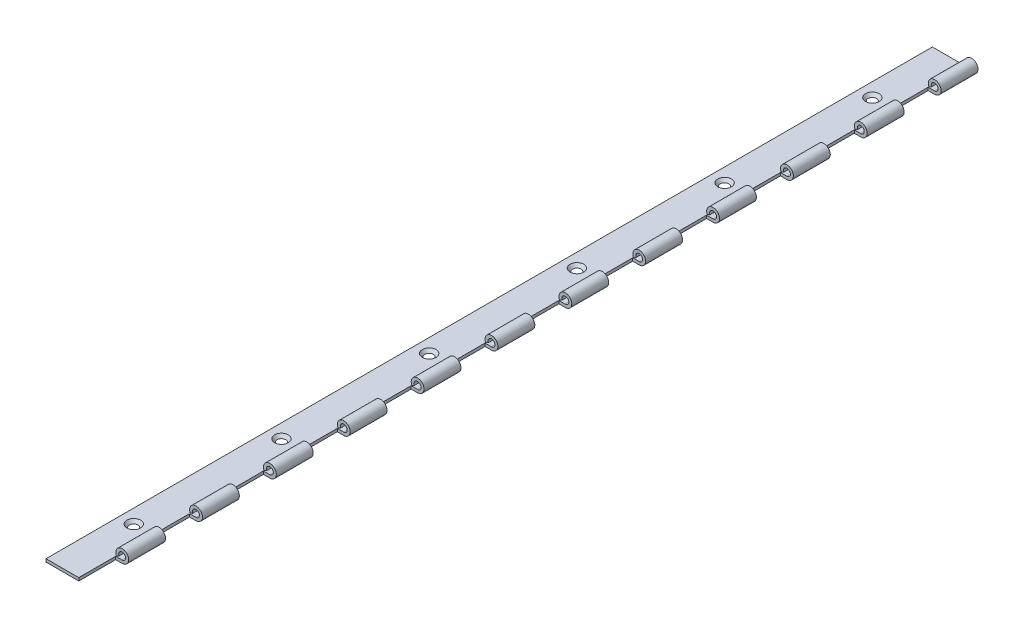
ISO-10303-21;
HEADER;
FILE_DESCRIPTION(('STEP AP214'),'2;1');
FILE_NAME('part.step','',(''),(''),'','','');
FILE_SCHEMA(('AUTOMOTIVE_DESIGN { 1 0 10303 214 1 1 1 1 }'));
ENDSEC;
DATA;
#1=APPLICATION_CONTEXT('core data for automotive mechanical design processes');
#2=APPLICATION_PROTOCOL_DEFINITION('international standard','automotive_design',2000,#1);
#3=PRODUCT_CONTEXT('',#1,'mechanical');
#4=PRODUCT('Part','Part','',(#3));
#5=PRODUCT_RELATED_PRODUCT_CATEGORY('part','',(#4));
#6=PRODUCT_DEFINITION_FORMATION('','',#4);
#7=PRODUCT_DEFINITION_CONTEXT('part definition',#1,'design');
#8=PRODUCT_DEFINITION('design','',#6,#7);
#9=PRODUCT_DEFINITION_SHAPE('','',#8);
#10=(LENGTH_UNIT() NAMED_UNIT(*) SI_UNIT(.MILLI.,.METRE.));
#11=(NAMED_UNIT(*) PLANE_ANGLE_UNIT() SI_UNIT($,.RADIAN.));
#12=(NAMED_UNIT(*) SI_UNIT($,.STERADIAN.) SOLID_ANGLE_UNIT());
#13=UNCERTAINTY_MEASURE_WITH_UNIT(LENGTH_MEASURE(1.E-05),#10,'distance_accuracy_value','');
#14=(GEOMETRIC_REPRESENTATION_CONTEXT(3) GLOBAL_UNCERTAINTY_ASSIGNED_CONTEXT((#13)) GLOBAL_UNIT_ASSIGNED_CONTEXT((#10,
#11,#12)) REPRESENTATION_CONTEXT('',''));
#15=CARTESIAN_POINT('',(0.,0.,0.));
#16=DIRECTION('',(0.,0.,1.));
#17=DIRECTION('',(1.,0.,0.));
#18=AXIS2_PLACEMENT_3D('',#15,#16,#17);
#19=CARTESIAN_POINT('',(-13.49375,-2.20599,-139.7));
#20=DIRECTION('',(0.,-1.,0.));
#21=DIRECTION('',(1.,0.,0.));
#22=AXIS2_PLACEMENT_3D('',#19,#20,#21);
#23=PLANE('',#22);
#24=CARTESIAN_POINT('',(-8.73125,-2.20599,25.4));
#25=DIRECTION('',(0.,-1.,0.));
#26=DIRECTION('',(1.,0.,0.));
#27=AXIS2_PLACEMENT_3D('',#24,#25,#26);
#28=CIRCLE('',#27,1.47319999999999);
#29=CARTESIAN_POINT('',(-7.25805,-2.20599,25.4));
#30=VERTEX_POINT('',#29);
#31=EDGE_CURVE('E2091',#30,#30,#28,.T.);
#32=ORIENTED_EDGE('',*,*,#31,.F.);
#33=EDGE_LOOP('',(#32));
#34=FACE_BOUND('',#33,.T.);
#35=CARTESIAN_POINT('',(-8.73125,-2.20599,-76.2));
#36=DIRECTION('',(0.,-1.,0.));
#37=DIRECTION('',(1.,0.,0.));
#38=AXIS2_PLACEMENT_3D('',#35,#36,#37);
#39=CIRCLE('',#38,1.47319999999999);
#40=CARTESIAN_POINT('',(-7.25805,-2.20599,-76.2));
#41=VERTEX_POINT('',#40);
#42=EDGE_CURVE('E2106',#41,#41,#39,.T.);
#43=ORIENTED_EDGE('',*,*,#42,.F.);
#44=EDGE_LOOP('',(#43));
#45=FACE_BOUND('',#44,.T.);
#46=CARTESIAN_POINT('',(-8.73125,-2.20599,127.));
#47=DIRECTION('',(0.,-1.,0.));
#48=DIRECTION('',(1.,0.,0.));
#49=AXIS2_PLACEMENT_3D('',#46,#47,#48);
#50=CIRCLE('',#49,1.47319999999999);
#51=CARTESIAN_POINT('',(-7.25805,-2.20599,127.));
#52=VERTEX_POINT('',#51);
#53=EDGE_CURVE('E2118',#52,#52,#50,.T.);
#54=ORIENTED_EDGE('',*,*,#53,.F.);
#55=EDGE_LOOP('',(#54));
#56=FACE_BOUND('',#55,.T.);
#57=DIRECTION('',(0.,0.,-1.));
#58=VECTOR('',#57,1.);
#59=CARTESIAN_POINT('',(-2.23139,-2.20599,152.4));
#60=LINE('',#59,#58);
#61=CARTESIAN_POINT('',(-2.23139,-2.20599,127.));
#62=VERTEX_POINT('',#61);
#63=CARTESIAN_POINT('',(-2.23139,-2.20599,114.3));
#64=VERTEX_POINT('',#63);
#65=EDGE_CURVE('E990',#62,#64,#60,.T.);
#66=ORIENTED_EDGE('',*,*,#65,.F.);
#67=DIRECTION('',(-1.,0.,0.));
#68=VECTOR('',#67,1.);
#69=CARTESIAN_POINT('',(-13.49375,-2.20599,127.));
#70=LINE('',#69,#68);
#71=CARTESIAN_POINT('',(0.,-2.20599,127.));
#72=VERTEX_POINT('',#71);
#73=EDGE_CURVE('E509',#72,#62,#70,.T.);
#74=ORIENTED_EDGE('',*,*,#73,.F.);
#75=DIRECTION('',(0.,0.,-1.));
#76=VECTOR('',#75,1.);
#77=CARTESIAN_POINT('',(0.,-2.20599,139.7));
#78=LINE('',#77,#76);
#79=CARTESIAN_POINT('',(0.,-2.20599,139.7));
#80=VERTEX_POINT('',#79);
#81=EDGE_CURVE('E545',#80,#72,#78,.T.);
#82=ORIENTED_EDGE('',*,*,#81,.F.);
#83=DIRECTION('',(-1.,0.,0.));
#84=VECTOR('',#83,1.);
#85=CARTESIAN_POINT('',(-13.49375,-2.20599,139.7));
#86=LINE('',#85,#84);
#87=CARTESIAN_POINT('',(-2.23139,-2.20599,139.7));
#88=VERTEX_POINT('',#87);
#89=EDGE_CURVE('E517',#80,#88,#86,.T.);
#90=ORIENTED_EDGE('',*,*,#89,.T.);
#91=CARTESIAN_POINT('',(-2.23139,-2.20599,152.4));
#92=VERTEX_POINT('',#91);
#93=EDGE_CURVE('E57',#92,#88,#60,.T.);
#94=ORIENTED_EDGE('',*,*,#93,.F.);
#95=DIRECTION('',(-1.,0.,0.));
#96=VECTOR('',#95,1.);
#97=CARTESIAN_POINT('',(-13.49375,-2.20599,152.4));
#98=LINE('',#97,#96);
#99=CARTESIAN_POINT('',(-13.49375,-2.20599,152.4));
#100=VERTEX_POINT('',#99);
#101=EDGE_CURVE('E984',#92,#100,#98,.T.);
#102=ORIENTED_EDGE('',*,*,#101,.T.);
#103=DIRECTION('',(0.,0.,-1.));
#104=VECTOR('',#103,1.);
#105=CARTESIAN_POINT('',(-13.49375,-2.20599,-139.7));
#106=LINE('',#105,#104);
#107=CARTESIAN_POINT('',(-13.49375,-2.20599,-152.4));
#108=VERTEX_POINT('',#107);
#109=EDGE_CURVE('E1028',#100,#108,#106,.T.);
#110=ORIENTED_EDGE('',*,*,#109,.T.);
#111=DIRECTION('',(-1.,0.,0.));
#112=VECTOR('',#111,1.);
#113=CARTESIAN_POINT('',(-13.49375,-2.20599,-152.4));
#114=LINE('',#113,#112);
#115=CARTESIAN_POINT('',(0.,-2.20599,-152.4));
#116=VERTEX_POINT('',#115);
#117=EDGE_CURVE('E1000',#116,#108,#114,.T.);
#118=ORIENTED_EDGE('',*,*,#117,.F.);
#119=DIRECTION('',(0.,0.,-1.));
#120=VECTOR('',#119,1.);
#121=CARTESIAN_POINT('',(0.,-2.20599,-139.7));
#122=LINE('',#121,#120);
#123=CARTESIAN_POINT('',(0.,-2.20599,-139.7));
#124=VERTEX_POINT('',#123);
#125=EDGE_CURVE('E1030',#124,#116,#122,.T.);
#126=ORIENTED_EDGE('',*,*,#125,.F.);
#127=DIRECTION('',(-1.,0.,0.));
#128=VECTOR('',#127,1.);
#129=CARTESIAN_POINT('',(-13.49375,-2.20599,-139.7));
#130=LINE('',#129,#128);
#131=CARTESIAN_POINT('',(-2.23139,-2.20599,-139.7));
#132=VERTEX_POINT('',#131);
#133=EDGE_CURVE('E1009',#124,#132,#130,.T.);
#134=ORIENTED_EDGE('',*,*,#133,.T.);
#135=CARTESIAN_POINT('',(-2.23139,-2.20599,-127.));
#136=VERTEX_POINT('',#135);
#137=EDGE_CURVE('E991',#136,#132,#60,.T.);
#138=ORIENTED_EDGE('',*,*,#137,.F.);
#139=DIRECTION('',(-1.,0.,0.));
#140=VECTOR('',#139,1.);
#141=CARTESIAN_POINT('',(-13.49375,-2.20599,-127.));
#142=LINE('',#141,#140);
#143=CARTESIAN_POINT('',(0.,-2.20599,-127.));
#144=VERTEX_POINT('',#143);
#145=EDGE_CURVE('E944',#144,#136,#142,.T.);
#146=ORIENTED_EDGE('',*,*,#145,.F.);
#147=DIRECTION('',(0.,0.,-1.));
#148=VECTOR('',#147,1.);
#149=CARTESIAN_POINT('',(0.,-2.20599,-114.3));
#150=LINE('',#149,#148);
#151=CARTESIAN_POINT('',(0.,-2.20599,-114.3));
#152=VERTEX_POINT('',#151);
#153=EDGE_CURVE('E969',#152,#144,#150,.T.);
#154=ORIENTED_EDGE('',*,*,#153,.F.);
#155=DIRECTION('',(-1.,0.,0.));
#156=VECTOR('',#155,1.);
#157=CARTESIAN_POINT('',(-13.49375,-2.20599,-114.3));
#158=LINE('',#157,#156);
#159=CARTESIAN_POINT('',(-2.23139,-2.20599,-114.3));
#160=VERTEX_POINT('',#159);
#161=EDGE_CURVE('E953',#152,#160,#158,.T.);
#162=ORIENTED_EDGE('',*,*,#161,.T.);
#163=CARTESIAN_POINT('',(-2.23139,-2.20599,-101.6));
#164=VERTEX_POINT('',#163);
#165=EDGE_CURVE('E1066',#164,#160,#60,.T.);
#166=ORIENTED_EDGE('',*,*,#165,.F.);
#167=DIRECTION('',(-1.,0.,0.));
#168=VECTOR('',#167,1.);
#169=CARTESIAN_POINT('',(-13.49375,-2.20599,-101.6));
#170=LINE('',#169,#168);
#171=CARTESIAN_POINT('',(0.,-2.20599,-101.6));
#172=VERTEX_POINT('',#171);
#173=EDGE_CURVE('E901',#172,#164,#170,.T.);
#174=ORIENTED_EDGE('',*,*,#173,.F.);
#175=DIRECTION('',(0.,0.,-1.));
#176=VECTOR('',#175,1.);
#177=CARTESIAN_POINT('',(0.,-2.20599,-88.9));
#178=LINE('',#177,#176);
#179=CARTESIAN_POINT('',(0.,-2.20599,-88.9));
#180=VERTEX_POINT('',#179);
#181=EDGE_CURVE('E926',#180,#172,#178,.T.);
#182=ORIENTED_EDGE('',*,*,#181,.F.);
#183=DIRECTION('',(-1.,0.,0.));
#184=VECTOR('',#183,1.);
#185=CARTESIAN_POINT('',(-13.49375,-2.20599,-88.9));
#186=LINE('',#185,#184);
#187=CARTESIAN_POINT('',(-2.23139,-2.20599,-88.8999999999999));
#188=VERTEX_POINT('',#187);
#189=EDGE_CURVE('E910',#180,#188,#186,.T.);
#190=ORIENTED_EDGE('',*,*,#189,.T.);
#191=CARTESIAN_POINT('',(-2.23139,-2.20599,-76.2));
#192=VERTEX_POINT('',#191);
#193=EDGE_CURVE('E1067',#192,#188,#60,.T.);
#194=ORIENTED_EDGE('',*,*,#193,.F.);
#195=DIRECTION('',(-1.,0.,0.));
#196=VECTOR('',#195,1.);
#197=CARTESIAN_POINT('',(-13.49375,-2.20599,-76.2));
#198=LINE('',#197,#196);
#199=CARTESIAN_POINT('',(0.,-2.20599,-76.2));
#200=VERTEX_POINT('',#199);
#201=EDGE_CURVE('E858',#200,#192,#198,.T.);
#202=ORIENTED_EDGE('',*,*,#201,.F.);
#203=DIRECTION('',(0.,0.,-1.));
#204=VECTOR('',#203,1.);
#205=CARTESIAN_POINT('',(0.,-2.20599,-63.5));
#206=LINE('',#205,#204);
#207=CARTESIAN_POINT('',(0.,-2.20599,-63.5));
#208=VERTEX_POINT('',#207);
#209=EDGE_CURVE('E883',#208,#200,#206,.T.);
#210=ORIENTED_EDGE('',*,*,#209,.F.);
#211=DIRECTION('',(-1.,0.,0.));
#212=VECTOR('',#211,1.);
#213=CARTESIAN_POINT('',(-13.49375,-2.20599,-63.5));
#214=LINE('',#213,#212);
#215=CARTESIAN_POINT('',(-2.23139,-2.20599,-63.5));
#216=VERTEX_POINT('',#215);
#217=EDGE_CURVE('E867',#208,#216,#214,.T.);
#218=ORIENTED_EDGE('',*,*,#217,.T.);
#219=CARTESIAN_POINT('',(-2.23139,-2.20599,-50.8));
#220=VERTEX_POINT('',#219);
#221=EDGE_CURVE('E1070',#220,#216,#60,.T.);
#222=ORIENTED_EDGE('',*,*,#221,.F.);
#223=DIRECTION('',(-1.,0.,0.));
#224=VECTOR('',#223,1.);
#225=CARTESIAN_POINT('',(-13.49375,-2.20599,-50.8));
#226=LINE('',#225,#224);
#227=CARTESIAN_POINT('',(0.,-2.20599,-50.8));
#228=VERTEX_POINT('',#227);
#229=EDGE_CURVE('E815',#228,#220,#226,.T.);
#230=ORIENTED_EDGE('',*,*,#229,.F.);
#231=DIRECTION('',(0.,0.,-1.));
#232=VECTOR('',#231,1.);
#233=CARTESIAN_POINT('',(0.,-2.20599,-38.1));
#234=LINE('',#233,#232);
#235=CARTESIAN_POINT('',(0.,-2.20599,-38.1));
#236=VERTEX_POINT('',#235);
#237=EDGE_CURVE('E840',#236,#228,#234,.T.);
#238=ORIENTED_EDGE('',*,*,#237,.F.);
#239=DIRECTION('',(-1.,0.,0.));
#240=VECTOR('',#239,1.);
#241=CARTESIAN_POINT('',(-13.49375,-2.20599,-38.1));
#242=LINE('',#241,#240);
#243=CARTESIAN_POINT('',(-2.23139,-2.20599,-38.1));
#244=VERTEX_POINT('',#243);
#245=EDGE_CURVE('E824',#236,#244,#242,.T.);
#246=ORIENTED_EDGE('',*,*,#245,.T.);
#247=CARTESIAN_POINT('',(-2.23139,-2.20599,-25.3999999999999));
#248=VERTEX_POINT('',#247);
#249=EDGE_CURVE('E1074',#248,#244,#60,.T.);
#250=ORIENTED_EDGE('',*,*,#249,.F.);
#251=DIRECTION('',(-1.,0.,0.));
#252=VECTOR('',#251,1.);
#253=CARTESIAN_POINT('',(-13.49375,-2.20599,-25.4));
#254=LINE('',#253,#252);
#255=CARTESIAN_POINT('',(0.,-2.20599,-25.4));
#256=VERTEX_POINT('',#255);
#257=EDGE_CURVE('E772',#256,#248,#254,.T.);
#258=ORIENTED_EDGE('',*,*,#257,.F.);
#259=DIRECTION('',(0.,0.,-1.));
#260=VECTOR('',#259,1.);
#261=CARTESIAN_POINT('',(0.,-2.20599,-12.7));
#262=LINE('',#261,#260);
#263=CARTESIAN_POINT('',(0.,-2.20599,-12.7));
#264=VERTEX_POINT('',#263);
#265=EDGE_CURVE('E797',#264,#256,#262,.T.);
#266=ORIENTED_EDGE('',*,*,#265,.F.);
#267=DIRECTION('',(-1.,0.,0.));
#268=VECTOR('',#267,1.);
#269=CARTESIAN_POINT('',(-13.49375,-2.20599,-12.7));
#270=LINE('',#269,#268);
#271=CARTESIAN_POINT('',(-2.23139,-2.20599,-12.7));
#272=VERTEX_POINT('',#271);
#273=EDGE_CURVE('E781',#264,#272,#270,.T.);
#274=ORIENTED_EDGE('',*,*,#273,.T.);
#275=CARTESIAN_POINT('',(-2.23139,-2.20599,0.));
#276=VERTEX_POINT('',#275);
#277=EDGE_CURVE('E1078',#276,#272,#60,.T.);
#278=ORIENTED_EDGE('',*,*,#277,.F.);
#279=DIRECTION('',(-1.,0.,0.));
#280=VECTOR('',#279,1.);
#281=CARTESIAN_POINT('',(-13.49375,-2.20599,0.));
#282=LINE('',#281,#280);
#283=CARTESIAN_POINT('',(0.,-2.20599,0.));
#284=VERTEX_POINT('',#283);
#285=EDGE_CURVE('E729',#284,#276,#282,.T.);
#286=ORIENTED_EDGE('',*,*,#285,.F.);
#287=DIRECTION('',(0.,0.,-1.));
#288=VECTOR('',#287,1.);
#289=CARTESIAN_POINT('',(0.,-2.20599,12.7));
#290=LINE('',#289,#288);
#291=CARTESIAN_POINT('',(0.,-2.20599,12.7));
#292=VERTEX_POINT('',#291);
#293=EDGE_CURVE('E754',#292,#284,#290,.T.);
#294=ORIENTED_EDGE('',*,*,#293,.F.);
#295=DIRECTION('',(-1.,0.,0.));
#296=VECTOR('',#295,1.);
#297=CARTESIAN_POINT('',(-13.49375,-2.20599,12.7));
#298=LINE('',#297,#296);
#299=CARTESIAN_POINT('',(-2.23139,-2.20599,12.7));
#300=VERTEX_POINT('',#299);
#301=EDGE_CURVE('E738',#292,#300,#298,.T.);
#302=ORIENTED_EDGE('',*,*,#301,.T.);
#303=CARTESIAN_POINT('',(-2.23139,-2.20599,25.4));
#304=VERTEX_POINT('',#303);
#305=EDGE_CURVE('E1082',#304,#300,#60,.T.);
#306=ORIENTED_EDGE('',*,*,#305,.F.);
#307=DIRECTION('',(-1.,0.,0.));
#308=VECTOR('',#307,1.);
#309=CARTESIAN_POINT('',(-13.49375,-2.20599,25.4));
#310=LINE('',#309,#308);
#311=CARTESIAN_POINT('',(0.,-2.20599,25.4));
#312=VERTEX_POINT('',#311);
#313=EDGE_CURVE('E686',#312,#304,#310,.T.);
#314=ORIENTED_EDGE('',*,*,#313,.F.);
#315=DIRECTION('',(0.,0.,-1.));
#316=VECTOR('',#315,1.);
#317=CARTESIAN_POINT('',(0.,-2.20599,38.1));
#318=LINE('',#317,#316);
#319=CARTESIAN_POINT('',(0.,-2.20599,38.1));
#320=VERTEX_POINT('',#319);
#321=EDGE_CURVE('E711',#320,#312,#318,.T.);
#322=ORIENTED_EDGE('',*,*,#321,.F.);
#323=DIRECTION('',(-1.,0.,0.));
#324=VECTOR('',#323,1.);
#325=CARTESIAN_POINT('',(-13.49375,-2.20599,38.1));
#326=LINE('',#325,#324);
#327=CARTESIAN_POINT('',(-2.23139,-2.20599,38.1));
#328=VERTEX_POINT('',#327);
#329=EDGE_CURVE('E695',#320,#328,#326,.T.);
#330=ORIENTED_EDGE('',*,*,#329,.T.);
#331=CARTESIAN_POINT('',(-2.23139,-2.20599,50.8));
#332=VERTEX_POINT('',#331);
#333=EDGE_CURVE('E1086',#332,#328,#60,.T.);
#334=ORIENTED_EDGE('',*,*,#333,.F.);
#335=DIRECTION('',(-1.,0.,0.));
#336=VECTOR('',#335,1.);
#337=CARTESIAN_POINT('',(-13.49375,-2.20599,50.8));
#338=LINE('',#337,#336);
#339=CARTESIAN_POINT('',(0.,-2.20599,50.8));
#340=VERTEX_POINT('',#339);
#341=EDGE_CURVE('E643',#340,#332,#338,.T.);
#342=ORIENTED_EDGE('',*,*,#341,.F.);
#343=DIRECTION('',(0.,0.,-1.));
#344=VECTOR('',#343,1.);
#345=CARTESIAN_POINT('',(0.,-2.20599,63.5));
#346=LINE('',#345,#344);
#347=CARTESIAN_POINT('',(0.,-2.20599,63.5));
#348=VERTEX_POINT('',#347);
#349=EDGE_CURVE('E668',#348,#340,#346,.T.);
#350=ORIENTED_EDGE('',*,*,#349,.F.);
#351=DIRECTION('',(-1.,0.,0.));
#352=VECTOR('',#351,1.);
#353=CARTESIAN_POINT('',(-13.49375,-2.20599,63.5));
#354=LINE('',#353,#352);
#355=CARTESIAN_POINT('',(-2.23139,-2.20599,63.5));
#356=VERTEX_POINT('',#355);
#357=EDGE_CURVE('E652',#348,#356,#354,.T.);
#358=ORIENTED_EDGE('',*,*,#357,.T.);
#359=CARTESIAN_POINT('',(-2.23139,-2.20599,76.2));
#360=VERTEX_POINT('',#359);
#361=EDGE_CURVE('E1090',#360,#356,#60,.T.);
#362=ORIENTED_EDGE('',*,*,#361,.F.);
#363=DIRECTION('',(-1.,0.,0.));
#364=VECTOR('',#363,1.);
#365=CARTESIAN_POINT('',(-13.49375,-2.20599,76.2));
#366=LINE('',#365,#364);
#367=CARTESIAN_POINT('',(0.,-2.20599,76.2));
#368=VERTEX_POINT('',#367);
#369=EDGE_CURVE('E600',#368,#360,#366,.T.);
#370=ORIENTED_EDGE('',*,*,#369,.F.);
#371=DIRECTION('',(0.,0.,-1.));
#372=VECTOR('',#371,1.);
#373=CARTESIAN_POINT('',(0.,-2.20599,88.9));
#374=LINE('',#373,#372);
#375=CARTESIAN_POINT('',(0.,-2.20599,88.9));
#376=VERTEX_POINT('',#375);
#377=EDGE_CURVE('E625',#376,#368,#374,.T.);
#378=ORIENTED_EDGE('',*,*,#377,.F.);
#379=DIRECTION('',(-1.,0.,0.));
#380=VECTOR('',#379,1.);
#381=CARTESIAN_POINT('',(-13.49375,-2.20599,88.9));
#382=LINE('',#381,#380);
#383=CARTESIAN_POINT('',(-2.23139,-2.20599,88.9));
#384=VERTEX_POINT('',#383);
#385=EDGE_CURVE('E609',#376,#384,#382,.T.);
#386=ORIENTED_EDGE('',*,*,#385,.T.);
#387=CARTESIAN_POINT('',(-2.23139,-2.20599,101.6));
#388=VERTEX_POINT('',#387);
#389=EDGE_CURVE('E1094',#388,#384,#60,.T.);
#390=ORIENTED_EDGE('',*,*,#389,.F.);
#391=DIRECTION('',(-1.,0.,0.));
#392=VECTOR('',#391,1.);
#393=CARTESIAN_POINT('',(-13.49375,-2.20599,101.6));
#394=LINE('',#393,#392);
#395=CARTESIAN_POINT('',(0.,-2.20599,101.6));
#396=VERTEX_POINT('',#395);
#397=EDGE_CURVE('E557',#396,#388,#394,.T.);
#398=ORIENTED_EDGE('',*,*,#397,.F.);
#399=DIRECTION('',(0.,0.,-1.));
#400=VECTOR('',#399,1.);
#401=CARTESIAN_POINT('',(0.,-2.20599,114.3));
#402=LINE('',#401,#400);
#403=CARTESIAN_POINT('',(0.,-2.20599,114.3));
#404=VERTEX_POINT('',#403);
#405=EDGE_CURVE('E582',#404,#396,#402,.T.);
#406=ORIENTED_EDGE('',*,*,#405,.F.);
#407=DIRECTION('',(-1.,0.,0.));
#408=VECTOR('',#407,1.);
#409=CARTESIAN_POINT('',(-13.49375,-2.20599,114.3));
#410=LINE('',#409,#408);
#411=EDGE_CURVE('E566',#404,#64,#410,.T.);
#412=ORIENTED_EDGE('',*,*,#411,.T.);
#413=EDGE_LOOP('',(#66,#74,#82,#90,#94,#102,#110,#118,#126,#134,#138,#146,#154,#162,#166,#174,
#182,#190,#194,#202,#210,#218,#222,#230,#238,#246,#250,#258,#266,#274,#278,#286,#294,#302,#306,
#314,#322,#330,#334,#342,#350,#358,#362,#370,#378,#386,#390,#398,#406,#412));
#414=FACE_BOUND('',#413,.T.);
#415=CARTESIAN_POINT('',(-8.73125,-2.20599,-127.));
#416=DIRECTION('',(0.,-1.,0.));
#417=DIRECTION('',(1.,0.,0.));
#418=AXIS2_PLACEMENT_3D('',#415,#416,#417);
#419=CIRCLE('',#418,1.47319999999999);
#420=CARTESIAN_POINT('',(-7.25805,-2.20599,-127.));
#421=VERTEX_POINT('',#420);
#422=EDGE_CURVE('E2112',#421,#421,#419,.T.);
#423=ORIENTED_EDGE('',*,*,#422,.F.);
#424=EDGE_LOOP('',(#423));
#425=FACE_BOUND('',#424,.T.);
#426=CARTESIAN_POINT('',(-8.73125,-2.20599,-25.4));
#427=DIRECTION('',(0.,-1.,0.));
#428=DIRECTION('',(1.,0.,0.));
#429=AXIS2_PLACEMENT_3D('',#426,#427,#428);
#430=CIRCLE('',#429,1.47319999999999);
#431=CARTESIAN_POINT('',(-7.25805,-2.20599,-25.4));
#432=VERTEX_POINT('',#431);
#433=EDGE_CURVE('E2100',#432,#432,#430,.T.);
#434=ORIENTED_EDGE('',*,*,#433,.F.);
#435=EDGE_LOOP('',(#434));
#436=FACE_BOUND('',#435,.T.);
#437=CARTESIAN_POINT('',(-8.73125,-2.20599,76.2));
#438=DIRECTION('',(0.,-1.,0.));
#439=DIRECTION('',(1.,0.,0.));
#440=AXIS2_PLACEMENT_3D('',#437,#438,#439);
#441=CIRCLE('',#440,1.47319999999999);
#442=CARTESIAN_POINT('',(-7.25805,-2.20599,76.2));
#443=VERTEX_POINT('',#442);
#444=EDGE_CURVE('E2086',#443,#443,#441,.T.);
#445=ORIENTED_EDGE('',*,*,#444,.F.);
#446=EDGE_LOOP('',(#445));
#447=FACE_BOUND('',#446,.T.);
#448=ADVANCED_FACE('F34',(#34,#45,#56,#414,#425,#436,#447),#23,.T.);
#449=CARTESIAN_POINT('',(-0.0388804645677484,-1.18999,-139.7));
#450=DIRECTION('',(0.,1.,0.));
#451=DIRECTION('',(-1.,0.,0.));
#452=AXIS2_PLACEMENT_3D('',#449,#450,#451);
#453=PLANE('',#452);
#454=CARTESIAN_POINT('',(-8.73125,-1.18999,25.4));
#455=DIRECTION('',(0.,1.,0.));
#456=DIRECTION('',(-1.,0.,0.));
#457=AXIS2_PLACEMENT_3D('',#454,#455,#456);
#458=CIRCLE('',#457,2.35639532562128);
#459=CARTESIAN_POINT('',(-11.0876453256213,-1.18999,25.4));
#460=VERTEX_POINT('',#459);
#461=EDGE_CURVE('E2094',#460,#460,#458,.F.);
#462=ORIENTED_EDGE('',*,*,#461,.T.);
#463=EDGE_LOOP('',(#462));
#464=FACE_BOUND('',#463,.T.);
#465=CARTESIAN_POINT('',(-8.73125,-1.18999,-76.2));
#466=DIRECTION('',(0.,1.,0.));
#467=DIRECTION('',(-1.,0.,0.));
#468=AXIS2_PLACEMENT_3D('',#465,#466,#467);
#469=CIRCLE('',#468,2.35639532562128);
#470=CARTESIAN_POINT('',(-11.0876453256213,-1.18999,-76.2));
#471=VERTEX_POINT('',#470);
#472=EDGE_CURVE('E2109',#471,#471,#469,.F.);
#473=ORIENTED_EDGE('',*,*,#472,.T.);
#474=EDGE_LOOP('',(#473));
#475=FACE_BOUND('',#474,.T.);
#476=CARTESIAN_POINT('',(-8.73125,-1.18999,127.));
#477=DIRECTION('',(0.,1.,0.));
#478=DIRECTION('',(-1.,0.,0.));
#479=AXIS2_PLACEMENT_3D('',#476,#477,#478);
#480=CIRCLE('',#479,2.35639532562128);
#481=CARTESIAN_POINT('',(-11.0876453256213,-1.18999,127.));
#482=VERTEX_POINT('',#481);
#483=EDGE_CURVE('E535',#482,#482,#480,.F.);
#484=ORIENTED_EDGE('',*,*,#483,.T.);
#485=EDGE_LOOP('',(#484));
#486=FACE_BOUND('',#485,.T.);
#487=DIRECTION('',(1.,0.,0.));
#488=VECTOR('',#487,1.);
#489=CARTESIAN_POINT('',(-0.0388804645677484,-1.18999,-152.4));
#490=LINE('',#489,#488);
#491=CARTESIAN_POINT('',(-13.49375,-1.18999,-152.4));
#492=VERTEX_POINT('',#491);
#493=CARTESIAN_POINT('',(-0.0388804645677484,-1.18999,-152.4));
#494=VERTEX_POINT('',#493);
#495=EDGE_CURVE('E1015',#492,#494,#490,.T.);
#496=ORIENTED_EDGE('',*,*,#495,.F.);
#497=DIRECTION('',(0.,0.,-1.));
#498=VECTOR('',#497,1.);
#499=CARTESIAN_POINT('',(-13.49375,-1.18999,-139.7));
#500=LINE('',#499,#498);
#501=CARTESIAN_POINT('',(-13.49375,-1.18999,152.4));
#502=VERTEX_POINT('',#501);
#503=EDGE_CURVE('E1012',#502,#492,#500,.T.);
#504=ORIENTED_EDGE('',*,*,#503,.F.);
#505=DIRECTION('',(1.,0.,0.));
#506=VECTOR('',#505,1.);
#507=CARTESIAN_POINT('',(-13.49375,-1.18999,152.4));
#508=LINE('',#507,#506);
#509=CARTESIAN_POINT('',(-2.23139,-1.18999,152.4));
#510=VERTEX_POINT('',#509);
#511=EDGE_CURVE('E980',#502,#510,#508,.T.);
#512=ORIENTED_EDGE('',*,*,#511,.T.);
#513=DIRECTION('',(0.,0.,-1.));
#514=VECTOR('',#513,1.);
#515=CARTESIAN_POINT('',(-2.23139,-1.18999,152.4));
#516=LINE('',#515,#514);
#517=CARTESIAN_POINT('',(-2.23139,-1.18999,139.7));
#518=VERTEX_POINT('',#517);
#519=EDGE_CURVE('E505',#510,#518,#516,.T.);
#520=ORIENTED_EDGE('',*,*,#519,.T.);
#521=DIRECTION('',(1.,0.,0.));
#522=VECTOR('',#521,1.);
#523=CARTESIAN_POINT('',(-0.0388804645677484,-1.18999,139.7));
#524=LINE('',#523,#522);
#525=CARTESIAN_POINT('',(-0.0388804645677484,-1.18999,139.7));
#526=VERTEX_POINT('',#525);
#527=EDGE_CURVE('E496',#518,#526,#524,.T.);
#528=ORIENTED_EDGE('',*,*,#527,.T.);
#529=DIRECTION('',(0.,0.,-1.));
#530=VECTOR('',#529,1.);
#531=CARTESIAN_POINT('',(-0.0388804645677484,-1.18999,139.7));
#532=LINE('',#531,#530);
#533=CARTESIAN_POINT('',(-0.0388804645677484,-1.18999,127.));
#534=VERTEX_POINT('',#533);
#535=EDGE_CURVE('E502',#526,#534,#532,.T.);
#536=ORIENTED_EDGE('',*,*,#535,.T.);
#537=DIRECTION('',(1.,0.,0.));
#538=VECTOR('',#537,1.);
#539=CARTESIAN_POINT('',(-0.0388804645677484,-1.18999,127.));
#540=LINE('',#539,#538);
#541=CARTESIAN_POINT('',(-2.23139,-1.18999,127.));
#542=VERTEX_POINT('',#541);
#543=EDGE_CURVE('E533',#542,#534,#540,.T.);
#544=ORIENTED_EDGE('',*,*,#543,.F.);
#545=CARTESIAN_POINT('',(-2.23139,-1.18999,114.3));
#546=VERTEX_POINT('',#545);
#547=EDGE_CURVE('E993',#542,#546,#516,.T.);
#548=ORIENTED_EDGE('',*,*,#547,.T.);
#549=DIRECTION('',(1.,0.,0.));
#550=VECTOR('',#549,1.);
#551=CARTESIAN_POINT('',(-0.0388804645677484,-1.18999,114.3));
#552=LINE('',#551,#550);
#553=CARTESIAN_POINT('',(-0.0388804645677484,-1.18999,114.3));
#554=VERTEX_POINT('',#553);
#555=EDGE_CURVE('E554',#546,#554,#552,.T.);
#556=ORIENTED_EDGE('',*,*,#555,.T.);
#557=DIRECTION('',(0.,0.,-1.));
#558=VECTOR('',#557,1.);
#559=CARTESIAN_POINT('',(-0.0388804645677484,-1.18999,114.3));
#560=LINE('',#559,#558);
#561=CARTESIAN_POINT('',(-0.0388804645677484,-1.18999,101.6));
#562=VERTEX_POINT('',#561);
#563=EDGE_CURVE('E569',#554,#562,#560,.T.);
#564=ORIENTED_EDGE('',*,*,#563,.T.);
#565=DIRECTION('',(1.,0.,0.));
#566=VECTOR('',#565,1.);
#567=CARTESIAN_POINT('',(-0.0388804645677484,-1.18999,101.6));
#568=LINE('',#567,#566);
#569=CARTESIAN_POINT('',(-2.23139,-1.18999,101.6));
#570=VERTEX_POINT('',#569);
#571=EDGE_CURVE('E553',#570,#562,#568,.T.);
#572=ORIENTED_EDGE('',*,*,#571,.F.);
#573=CARTESIAN_POINT('',(-2.23139,-1.18999,88.9));
#574=VERTEX_POINT('',#573);
#575=EDGE_CURVE('E1123',#570,#574,#516,.T.);
#576=ORIENTED_EDGE('',*,*,#575,.T.);
#577=DIRECTION('',(1.,0.,0.));
#578=VECTOR('',#577,1.);
#579=CARTESIAN_POINT('',(-0.0388804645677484,-1.18999,88.9));
#580=LINE('',#579,#578);
#581=CARTESIAN_POINT('',(-0.0388804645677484,-1.18999,88.9));
#582=VERTEX_POINT('',#581);
#583=EDGE_CURVE('E597',#574,#582,#580,.T.);
#584=ORIENTED_EDGE('',*,*,#583,.T.);
#585=DIRECTION('',(0.,0.,-1.));
#586=VECTOR('',#585,1.);
#587=CARTESIAN_POINT('',(-0.0388804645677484,-1.18999,88.9));
#588=LINE('',#587,#586);
#589=CARTESIAN_POINT('',(-0.0388804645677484,-1.18999,76.2));
#590=VERTEX_POINT('',#589);
#591=EDGE_CURVE('E612',#582,#590,#588,.T.);
#592=ORIENTED_EDGE('',*,*,#591,.T.);
#593=DIRECTION('',(1.,0.,0.));
#594=VECTOR('',#593,1.);
#595=CARTESIAN_POINT('',(-0.0388804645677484,-1.18999,76.2));
#596=LINE('',#595,#594);
#597=CARTESIAN_POINT('',(-2.23139,-1.18999,76.2));
#598=VERTEX_POINT('',#597);
#599=EDGE_CURVE('E596',#598,#590,#596,.T.);
#600=ORIENTED_EDGE('',*,*,#599,.F.);
#601=CARTESIAN_POINT('',(-2.23139,-1.18999,63.5));
#602=VERTEX_POINT('',#601);
#603=EDGE_CURVE('E1124',#598,#602,#516,.T.);
#604=ORIENTED_EDGE('',*,*,#603,.T.);
#605=DIRECTION('',(1.,0.,0.));
#606=VECTOR('',#605,1.);
#607=CARTESIAN_POINT('',(-0.0388804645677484,-1.18999,63.5));
#608=LINE('',#607,#606);
#609=CARTESIAN_POINT('',(-0.0388804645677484,-1.18999,63.5));
#610=VERTEX_POINT('',#609);
#611=EDGE_CURVE('E640',#602,#610,#608,.T.);
#612=ORIENTED_EDGE('',*,*,#611,.T.);
#613=DIRECTION('',(0.,0.,-1.));
#614=VECTOR('',#613,1.);
#615=CARTESIAN_POINT('',(-0.0388804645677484,-1.18999,63.5));
#616=LINE('',#615,#614);
#617=CARTESIAN_POINT('',(-0.0388804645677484,-1.18999,50.8));
#618=VERTEX_POINT('',#617);
#619=EDGE_CURVE('E655',#610,#618,#616,.T.);
#620=ORIENTED_EDGE('',*,*,#619,.T.);
#621=DIRECTION('',(1.,0.,0.));
#622=VECTOR('',#621,1.);
#623=CARTESIAN_POINT('',(-0.0388804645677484,-1.18999,50.8));
#624=LINE('',#623,#622);
#625=CARTESIAN_POINT('',(-2.23139,-1.18999,50.8));
#626=VERTEX_POINT('',#625);
#627=EDGE_CURVE('E639',#626,#618,#624,.T.);
#628=ORIENTED_EDGE('',*,*,#627,.F.);
#629=CARTESIAN_POINT('',(-2.23139,-1.18999,38.1));
#630=VERTEX_POINT('',#629);
#631=EDGE_CURVE('E1125',#626,#630,#516,.T.);
#632=ORIENTED_EDGE('',*,*,#631,.T.);
#633=DIRECTION('',(1.,0.,0.));
#634=VECTOR('',#633,1.);
#635=CARTESIAN_POINT('',(-0.0388804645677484,-1.18999,38.1));
#636=LINE('',#635,#634);
#637=CARTESIAN_POINT('',(-0.0388804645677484,-1.18999,38.1));
#638=VERTEX_POINT('',#637);
#639=EDGE_CURVE('E683',#630,#638,#636,.T.);
#640=ORIENTED_EDGE('',*,*,#639,.T.);
#641=DIRECTION('',(0.,0.,-1.));
#642=VECTOR('',#641,1.);
#643=CARTESIAN_POINT('',(-0.0388804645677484,-1.18999,38.1));
#644=LINE('',#643,#642);
#645=CARTESIAN_POINT('',(-0.0388804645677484,-1.18999,25.4));
#646=VERTEX_POINT('',#645);
#647=EDGE_CURVE('E698',#638,#646,#644,.T.);
#648=ORIENTED_EDGE('',*,*,#647,.T.);
#649=DIRECTION('',(1.,0.,0.));
#650=VECTOR('',#649,1.);
#651=CARTESIAN_POINT('',(-0.0388804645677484,-1.18999,25.4));
#652=LINE('',#651,#650);
#653=CARTESIAN_POINT('',(-2.23139,-1.18999,25.4));
#654=VERTEX_POINT('',#653);
#655=EDGE_CURVE('E682',#654,#646,#652,.T.);
#656=ORIENTED_EDGE('',*,*,#655,.F.);
#657=CARTESIAN_POINT('',(-2.23139,-1.18999,12.7));
#658=VERTEX_POINT('',#657);
#659=EDGE_CURVE('E1127',#654,#658,#516,.T.);
#660=ORIENTED_EDGE('',*,*,#659,.T.);
#661=DIRECTION('',(1.,0.,0.));
#662=VECTOR('',#661,1.);
#663=CARTESIAN_POINT('',(-0.0388804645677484,-1.18999,12.7));
#664=LINE('',#663,#662);
#665=CARTESIAN_POINT('',(-0.0388804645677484,-1.18999,12.7));
#666=VERTEX_POINT('',#665);
#667=EDGE_CURVE('E726',#658,#666,#664,.T.);
#668=ORIENTED_EDGE('',*,*,#667,.T.);
#669=DIRECTION('',(0.,0.,-1.));
#670=VECTOR('',#669,1.);
#671=CARTESIAN_POINT('',(-0.0388804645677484,-1.18999,12.7));
#672=LINE('',#671,#670);
#673=CARTESIAN_POINT('',(-0.0388804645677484,-1.18999,0.));
#674=VERTEX_POINT('',#673);
#675=EDGE_CURVE('E741',#666,#674,#672,.T.);
#676=ORIENTED_EDGE('',*,*,#675,.T.);
#677=DIRECTION('',(1.,0.,0.));
#678=VECTOR('',#677,1.);
#679=CARTESIAN_POINT('',(-0.0388804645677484,-1.18999,0.));
#680=LINE('',#679,#678);
#681=CARTESIAN_POINT('',(-2.23139,-1.18999,0.));
#682=VERTEX_POINT('',#681);
#683=EDGE_CURVE('E725',#682,#674,#680,.T.);
#684=ORIENTED_EDGE('',*,*,#683,.F.);
#685=CARTESIAN_POINT('',(-2.23139,-1.18999,-12.7));
#686=VERTEX_POINT('',#685);
#687=EDGE_CURVE('E1129',#682,#686,#516,.T.);
#688=ORIENTED_EDGE('',*,*,#687,.T.);
#689=DIRECTION('',(1.,0.,0.));
#690=VECTOR('',#689,1.);
#691=CARTESIAN_POINT('',(-0.0388804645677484,-1.18999,-12.7));
#692=LINE('',#691,#690);
#693=CARTESIAN_POINT('',(-0.0388804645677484,-1.18999,-12.7));
#694=VERTEX_POINT('',#693);
#695=EDGE_CURVE('E769',#686,#694,#692,.T.);
#696=ORIENTED_EDGE('',*,*,#695,.T.);
#697=DIRECTION('',(0.,0.,-1.));
#698=VECTOR('',#697,1.);
#699=CARTESIAN_POINT('',(-0.0388804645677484,-1.18999,-12.7));
#700=LINE('',#699,#698);
#701=CARTESIAN_POINT('',(-0.0388804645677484,-1.18999,-25.4));
#702=VERTEX_POINT('',#701);
#703=EDGE_CURVE('E784',#694,#702,#700,.T.);
#704=ORIENTED_EDGE('',*,*,#703,.T.);
#705=DIRECTION('',(1.,0.,0.));
#706=VECTOR('',#705,1.);
#707=CARTESIAN_POINT('',(-0.0388804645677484,-1.18999,-25.4));
#708=LINE('',#707,#706);
#709=CARTESIAN_POINT('',(-2.23139,-1.18999,-25.4));
#710=VERTEX_POINT('',#709);
#711=EDGE_CURVE('E768',#710,#702,#708,.T.);
#712=ORIENTED_EDGE('',*,*,#711,.F.);
#713=CARTESIAN_POINT('',(-2.23139,-1.18999,-38.1));
#714=VERTEX_POINT('',#713);
#715=EDGE_CURVE('E1131',#710,#714,#516,.T.);
#716=ORIENTED_EDGE('',*,*,#715,.T.);
#717=DIRECTION('',(1.,0.,0.));
#718=VECTOR('',#717,1.);
#719=CARTESIAN_POINT('',(-0.0388804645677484,-1.18999,-38.1));
#720=LINE('',#719,#718);
#721=CARTESIAN_POINT('',(-0.0388804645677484,-1.18999,-38.1));
#722=VERTEX_POINT('',#721);
#723=EDGE_CURVE('E812',#714,#722,#720,.T.);
#724=ORIENTED_EDGE('',*,*,#723,.T.);
#725=DIRECTION('',(0.,0.,-1.));
#726=VECTOR('',#725,1.);
#727=CARTESIAN_POINT('',(-0.0388804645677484,-1.18999,-38.1));
#728=LINE('',#727,#726);
#729=CARTESIAN_POINT('',(-0.0388804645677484,-1.18999,-50.8));
#730=VERTEX_POINT('',#729);
#731=EDGE_CURVE('E827',#722,#730,#728,.T.);
#732=ORIENTED_EDGE('',*,*,#731,.T.);
#733=DIRECTION('',(1.,0.,0.));
#734=VECTOR('',#733,1.);
#735=CARTESIAN_POINT('',(-0.0388804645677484,-1.18999,-50.8));
#736=LINE('',#735,#734);
#737=CARTESIAN_POINT('',(-2.23139,-1.18999,-50.8));
#738=VERTEX_POINT('',#737);
#739=EDGE_CURVE('E811',#738,#730,#736,.T.);
#740=ORIENTED_EDGE('',*,*,#739,.F.);
#741=CARTESIAN_POINT('',(-2.23139,-1.18999,-63.5));
#742=VERTEX_POINT('',#741);
#743=EDGE_CURVE('E1133',#738,#742,#516,.T.);
#744=ORIENTED_EDGE('',*,*,#743,.T.);
#745=DIRECTION('',(1.,0.,0.));
#746=VECTOR('',#745,1.);
#747=CARTESIAN_POINT('',(-0.0388804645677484,-1.18999,-63.5));
#748=LINE('',#747,#746);
#749=CARTESIAN_POINT('',(-0.0388804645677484,-1.18999,-63.5));
#750=VERTEX_POINT('',#749);
#751=EDGE_CURVE('E855',#742,#750,#748,.T.);
#752=ORIENTED_EDGE('',*,*,#751,.T.);
#753=DIRECTION('',(0.,0.,-1.));
#754=VECTOR('',#753,1.);
#755=CARTESIAN_POINT('',(-0.0388804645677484,-1.18999,-63.5));
#756=LINE('',#755,#754);
#757=CARTESIAN_POINT('',(-0.0388804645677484,-1.18999,-76.2));
#758=VERTEX_POINT('',#757);
#759=EDGE_CURVE('E870',#750,#758,#756,.T.);
#760=ORIENTED_EDGE('',*,*,#759,.T.);
#761=DIRECTION('',(1.,0.,0.));
#762=VECTOR('',#761,1.);
#763=CARTESIAN_POINT('',(-0.0388804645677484,-1.18999,-76.2));
#764=LINE('',#763,#762);
#765=CARTESIAN_POINT('',(-2.23139,-1.18999,-76.2));
#766=VERTEX_POINT('',#765);
#767=EDGE_CURVE('E854',#766,#758,#764,.T.);
#768=ORIENTED_EDGE('',*,*,#767,.F.);
#769=CARTESIAN_POINT('',(-2.23139,-1.18999,-88.8999999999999));
#770=VERTEX_POINT('',#769);
#771=EDGE_CURVE('E1135',#766,#770,#516,.T.);
#772=ORIENTED_EDGE('',*,*,#771,.T.);
#773=DIRECTION('',(1.,0.,0.));
#774=VECTOR('',#773,1.);
#775=CARTESIAN_POINT('',(-0.0388804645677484,-1.18999,-88.9));
#776=LINE('',#775,#774);
#777=CARTESIAN_POINT('',(-0.0388804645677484,-1.18999,-88.9));
#778=VERTEX_POINT('',#777);
#779=EDGE_CURVE('E898',#770,#778,#776,.T.);
#780=ORIENTED_EDGE('',*,*,#779,.T.);
#781=DIRECTION('',(0.,0.,-1.));
#782=VECTOR('',#781,1.);
#783=CARTESIAN_POINT('',(-0.0388804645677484,-1.18999,-88.9));
#784=LINE('',#783,#782);
#785=CARTESIAN_POINT('',(-0.0388804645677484,-1.18999,-101.6));
#786=VERTEX_POINT('',#785);
#787=EDGE_CURVE('E913',#778,#786,#784,.T.);
#788=ORIENTED_EDGE('',*,*,#787,.T.);
#789=DIRECTION('',(1.,0.,0.));
#790=VECTOR('',#789,1.);
#791=CARTESIAN_POINT('',(-0.0388804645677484,-1.18999,-101.6));
#792=LINE('',#791,#790);
#793=CARTESIAN_POINT('',(-2.23139,-1.18999,-101.6));
#794=VERTEX_POINT('',#793);
#795=EDGE_CURVE('E897',#794,#786,#792,.T.);
#796=ORIENTED_EDGE('',*,*,#795,.F.);
#797=CARTESIAN_POINT('',(-2.23139,-1.18999,-114.3));
#798=VERTEX_POINT('',#797);
#799=EDGE_CURVE('E1137',#794,#798,#516,.T.);
#800=ORIENTED_EDGE('',*,*,#799,.T.);
#801=DIRECTION('',(1.,0.,0.));
#802=VECTOR('',#801,1.);
#803=CARTESIAN_POINT('',(-0.0388804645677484,-1.18999,-114.3));
#804=LINE('',#803,#802);
#805=CARTESIAN_POINT('',(-0.0388804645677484,-1.18999,-114.3));
#806=VERTEX_POINT('',#805);
#807=EDGE_CURVE('E941',#798,#806,#804,.T.);
#808=ORIENTED_EDGE('',*,*,#807,.T.);
#809=DIRECTION('',(0.,0.,-1.));
#810=VECTOR('',#809,1.);
#811=CARTESIAN_POINT('',(-0.0388804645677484,-1.18999,-114.3));
#812=LINE('',#811,#810);
#813=CARTESIAN_POINT('',(-0.0388804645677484,-1.18999,-127.));
#814=VERTEX_POINT('',#813);
#815=EDGE_CURVE('E956',#806,#814,#812,.T.);
#816=ORIENTED_EDGE('',*,*,#815,.T.);
#817=DIRECTION('',(1.,0.,0.));
#818=VECTOR('',#817,1.);
#819=CARTESIAN_POINT('',(-0.0388804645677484,-1.18999,-127.));
#820=LINE('',#819,#818);
#821=CARTESIAN_POINT('',(-2.23139,-1.18999,-127.));
#822=VERTEX_POINT('',#821);
#823=EDGE_CURVE('E940',#822,#814,#820,.T.);
#824=ORIENTED_EDGE('',*,*,#823,.F.);
#825=CARTESIAN_POINT('',(-2.23139,-1.18999,-139.7));
#826=VERTEX_POINT('',#825);
#827=EDGE_CURVE('E987',#822,#826,#516,.T.);
#828=ORIENTED_EDGE('',*,*,#827,.T.);
#829=DIRECTION('',(1.,0.,0.));
#830=VECTOR('',#829,1.);
#831=CARTESIAN_POINT('',(-0.0388804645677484,-1.18999,-139.7));
#832=LINE('',#831,#830);
#833=CARTESIAN_POINT('',(-0.0388804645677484,-1.18999,-139.7));
#834=VERTEX_POINT('',#833);
#835=EDGE_CURVE('E997',#826,#834,#832,.T.);
#836=ORIENTED_EDGE('',*,*,#835,.T.);
#837=DIRECTION('',(0.,0.,-1.));
#838=VECTOR('',#837,1.);
#839=CARTESIAN_POINT('',(-0.0388804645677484,-1.18999,-139.7));
#840=LINE('',#839,#838);
#841=EDGE_CURVE('E1036',#834,#494,#840,.T.);
#842=ORIENTED_EDGE('',*,*,#841,.T.);
#843=EDGE_LOOP('',(#496,#504,#512,#520,#528,#536,#544,#548,#556,#564,#572,#576,#584,#592,#600,
#604,#612,#620,#628,#632,#640,#648,#656,#660,#668,#676,#684,#688,#696,#704,#712,#716,#724,#732,
#740,#744,#752,#760,#768,#772,#780,#788,#796,#800,#808,#816,#824,#828,#836,#842));
#844=FACE_BOUND('',#843,.T.);
#845=CARTESIAN_POINT('',(-8.73125,-1.18999,-127.));
#846=DIRECTION('',(0.,1.,0.));
#847=DIRECTION('',(-1.,0.,0.));
#848=AXIS2_PLACEMENT_3D('',#845,#846,#847);
#849=CIRCLE('',#848,2.35639532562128);
#850=CARTESIAN_POINT('',(-11.0876453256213,-1.18999,-127.));
#851=VERTEX_POINT('',#850);
#852=EDGE_CURVE('E2115',#851,#851,#849,.F.);
#853=ORIENTED_EDGE('',*,*,#852,.T.);
#854=EDGE_LOOP('',(#853));
#855=FACE_BOUND('',#854,.T.);
#856=CARTESIAN_POINT('',(-8.73125,-1.18999,-25.4));
#857=DIRECTION('',(0.,1.,0.));
#858=DIRECTION('',(-1.,0.,0.));
#859=AXIS2_PLACEMENT_3D('',#856,#857,#858);
#860=CIRCLE('',#859,2.35639532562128);
#861=CARTESIAN_POINT('',(-11.0876453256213,-1.18999,-25.4));
#862=VERTEX_POINT('',#861);
#863=EDGE_CURVE('E2103',#862,#862,#860,.F.);
#864=ORIENTED_EDGE('',*,*,#863,.T.);
#865=EDGE_LOOP('',(#864));
#866=FACE_BOUND('',#865,.T.);
#867=CARTESIAN_POINT('',(-8.73125,-1.18999,76.2));
#868=DIRECTION('',(0.,1.,0.));
#869=DIRECTION('',(-1.,0.,0.));
#870=AXIS2_PLACEMENT_3D('',#867,#868,#869);
#871=CIRCLE('',#870,2.35639532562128);
#872=CARTESIAN_POINT('',(-11.0876453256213,-1.18999,76.2));
#873=VERTEX_POINT('',#872);
#874=EDGE_CURVE('E2089',#873,#873,#871,.F.);
#875=ORIENTED_EDGE('',*,*,#874,.T.);
#876=EDGE_LOOP('',(#875));
#877=FACE_BOUND('',#876,.T.);
#878=ADVANCED_FACE('F499',(#464,#475,#486,#844,#855,#866,#877),#453,.T.);
#879=CARTESIAN_POINT('',(-2.23139,-1.18999,152.4));
#880=DIRECTION('',(1.,0.,0.));
#881=DIRECTION('',(0.,1.,0.));
#882=AXIS2_PLACEMENT_3D('',#879,#880,#881);
#883=PLANE('',#882);
#884=ORIENTED_EDGE('',*,*,#93,.T.);
#885=DIRECTION('',(0.,1.,0.));
#886=VECTOR('',#885,1.);
#887=CARTESIAN_POINT('',(-2.23139,-1.18999,139.7));
#888=LINE('',#887,#886);
#889=EDGE_CURVE('E551',#88,#518,#888,.T.);
#890=ORIENTED_EDGE('',*,*,#889,.T.);
#891=ORIENTED_EDGE('',*,*,#519,.F.);
#892=DIRECTION('',(0.,-1.,0.));
#893=VECTOR('',#892,1.);
#894=CARTESIAN_POINT('',(-2.23139,-1.18999,152.4));
#895=LINE('',#894,#893);
#896=EDGE_CURVE('E982',#510,#92,#895,.T.);
#897=ORIENTED_EDGE('',*,*,#896,.T.);
#898=EDGE_LOOP('',(#884,#890,#891,#897));
#899=FACE_BOUND('',#898,.T.);
#900=ADVANCED_FACE('F1159',(#899),#883,.T.);
#901=DIRECTION('',(0.,1.,0.));
#902=VECTOR('',#901,1.);
#903=CARTESIAN_POINT('',(-2.23139,-1.18999,127.));
#904=LINE('',#903,#902);
#905=EDGE_CURVE('E49',#62,#542,#904,.T.);
#906=ORIENTED_EDGE('',*,*,#905,.F.);
#907=ORIENTED_EDGE('',*,*,#65,.T.);
#908=DIRECTION('',(0.,1.,0.));
#909=VECTOR('',#908,1.);
#910=CARTESIAN_POINT('',(-2.23139,-1.18999,114.3));
#911=LINE('',#910,#909);
#912=EDGE_CURVE('E593',#64,#546,#911,.T.);
#913=ORIENTED_EDGE('',*,*,#912,.T.);
#914=ORIENTED_EDGE('',*,*,#547,.F.);
#915=EDGE_LOOP('',(#906,#907,#913,#914));
#916=FACE_BOUND('',#915,.T.);
#917=ADVANCED_FACE('F1102',(#916),#883,.T.);
#918=DIRECTION('',(0.,1.,0.));
#919=VECTOR('',#918,1.);
#920=CARTESIAN_POINT('',(-2.23139,-1.18999,101.6));
#921=LINE('',#920,#919);
#922=EDGE_CURVE('E584',#388,#570,#921,.T.);
#923=ORIENTED_EDGE('',*,*,#922,.F.);
#924=ORIENTED_EDGE('',*,*,#389,.T.);
#925=DIRECTION('',(0.,1.,0.));
#926=VECTOR('',#925,1.);
#927=CARTESIAN_POINT('',(-2.23139,-1.18999,88.9));
#928=LINE('',#927,#926);
#929=EDGE_CURVE('E636',#384,#574,#928,.T.);
#930=ORIENTED_EDGE('',*,*,#929,.T.);
#931=ORIENTED_EDGE('',*,*,#575,.F.);
#932=EDGE_LOOP('',(#923,#924,#930,#931));
#933=FACE_BOUND('',#932,.T.);
#934=ADVANCED_FACE('F1483',(#933),#883,.T.);
#935=DIRECTION('',(0.,1.,0.));
#936=VECTOR('',#935,1.);
#937=CARTESIAN_POINT('',(-2.23139,-1.18999,76.2));
#938=LINE('',#937,#936);
#939=EDGE_CURVE('E627',#360,#598,#938,.T.);
#940=ORIENTED_EDGE('',*,*,#939,.F.);
#941=ORIENTED_EDGE('',*,*,#361,.T.);
#942=DIRECTION('',(0.,1.,0.));
#943=VECTOR('',#942,1.);
#944=CARTESIAN_POINT('',(-2.23139,-1.18999,63.5));
#945=LINE('',#944,#943);
#946=EDGE_CURVE('E679',#356,#602,#945,.T.);
#947=ORIENTED_EDGE('',*,*,#946,.T.);
#948=ORIENTED_EDGE('',*,*,#603,.F.);
#949=EDGE_LOOP('',(#940,#941,#947,#948));
#950=FACE_BOUND('',#949,.T.);
#951=ADVANCED_FACE('F1473',(#950),#883,.T.);
#952=DIRECTION('',(0.,1.,0.));
#953=VECTOR('',#952,1.);
#954=CARTESIAN_POINT('',(-2.23139,-1.18999,50.8));
#955=LINE('',#954,#953);
#956=EDGE_CURVE('E670',#332,#626,#955,.T.);
#957=ORIENTED_EDGE('',*,*,#956,.F.);
#958=ORIENTED_EDGE('',*,*,#333,.T.);
#959=DIRECTION('',(0.,1.,0.));
#960=VECTOR('',#959,1.);
#961=CARTESIAN_POINT('',(-2.23139,-1.18999,38.1));
#962=LINE('',#961,#960);
#963=EDGE_CURVE('E722',#328,#630,#962,.T.);
#964=ORIENTED_EDGE('',*,*,#963,.T.);
#965=ORIENTED_EDGE('',*,*,#631,.F.);
#966=EDGE_LOOP('',(#957,#958,#964,#965));
#967=FACE_BOUND('',#966,.T.);
#968=ADVANCED_FACE('F1462',(#967),#883,.T.);
#969=DIRECTION('',(0.,1.,0.));
#970=VECTOR('',#969,1.);
#971=CARTESIAN_POINT('',(-2.23139,-1.18999,25.4));
#972=LINE('',#971,#970);
#973=EDGE_CURVE('E713',#304,#654,#972,.T.);
#974=ORIENTED_EDGE('',*,*,#973,.F.);
#975=ORIENTED_EDGE('',*,*,#305,.T.);
#976=DIRECTION('',(0.,1.,0.));
#977=VECTOR('',#976,1.);
#978=CARTESIAN_POINT('',(-2.23139,-1.18999,12.7));
#979=LINE('',#978,#977);
#980=EDGE_CURVE('E765',#300,#658,#979,.T.);
#981=ORIENTED_EDGE('',*,*,#980,.T.);
#982=ORIENTED_EDGE('',*,*,#659,.F.);
#983=EDGE_LOOP('',(#974,#975,#981,#982));
#984=FACE_BOUND('',#983,.T.);
#985=ADVANCED_FACE('F1451',(#984),#883,.T.);
#986=DIRECTION('',(0.,1.,0.));
#987=VECTOR('',#986,1.);
#988=CARTESIAN_POINT('',(-2.23139,-1.18999,0.));
#989=LINE('',#988,#987);
#990=EDGE_CURVE('E756',#276,#682,#989,.T.);
#991=ORIENTED_EDGE('',*,*,#990,.F.);
#992=ORIENTED_EDGE('',*,*,#277,.T.);
#993=DIRECTION('',(0.,1.,0.));
#994=VECTOR('',#993,1.);
#995=CARTESIAN_POINT('',(-2.23139,-1.18999,-12.7));
#996=LINE('',#995,#994);
#997=EDGE_CURVE('E808',#272,#686,#996,.T.);
#998=ORIENTED_EDGE('',*,*,#997,.T.);
#999=ORIENTED_EDGE('',*,*,#687,.F.);
#1000=EDGE_LOOP('',(#991,#992,#998,#999));
#1001=FACE_BOUND('',#1000,.T.);
#1002=ADVANCED_FACE('F1440',(#1001),#883,.T.);
#1003=DIRECTION('',(0.,1.,0.));
#1004=VECTOR('',#1003,1.);
#1005=CARTESIAN_POINT('',(-2.23139,-1.18999,-25.4));
#1006=LINE('',#1005,#1004);
#1007=EDGE_CURVE('E799',#248,#710,#1006,.T.);
#1008=ORIENTED_EDGE('',*,*,#1007,.F.);
#1009=ORIENTED_EDGE('',*,*,#249,.T.);
#1010=DIRECTION('',(0.,1.,0.));
#1011=VECTOR('',#1010,1.);
#1012=CARTESIAN_POINT('',(-2.23139,-1.18999,-38.1));
#1013=LINE('',#1012,#1011);
#1014=EDGE_CURVE('E851',#244,#714,#1013,.T.);
#1015=ORIENTED_EDGE('',*,*,#1014,.T.);
#1016=ORIENTED_EDGE('',*,*,#715,.F.);
#1017=EDGE_LOOP('',(#1008,#1009,#1015,#1016));
#1018=FACE_BOUND('',#1017,.T.);
#1019=ADVANCED_FACE('F1429',(#1018),#883,.T.);
#1020=DIRECTION('',(0.,1.,0.));
#1021=VECTOR('',#1020,1.);
#1022=CARTESIAN_POINT('',(-2.23139,-1.18999,-50.8));
#1023=LINE('',#1022,#1021);
#1024=EDGE_CURVE('E842',#220,#738,#1023,.T.);
#1025=ORIENTED_EDGE('',*,*,#1024,.F.);
#1026=ORIENTED_EDGE('',*,*,#221,.T.);
#1027=DIRECTION('',(0.,1.,0.));
#1028=VECTOR('',#1027,1.);
#1029=CARTESIAN_POINT('',(-2.23139,-1.18999,-63.5));
#1030=LINE('',#1029,#1028);
#1031=EDGE_CURVE('E894',#216,#742,#1030,.T.);
#1032=ORIENTED_EDGE('',*,*,#1031,.T.);
#1033=ORIENTED_EDGE('',*,*,#743,.F.);
#1034=EDGE_LOOP('',(#1025,#1026,#1032,#1033));
#1035=FACE_BOUND('',#1034,.T.);
#1036=ADVANCED_FACE('F1418',(#1035),#883,.T.);
#1037=DIRECTION('',(0.,1.,0.));
#1038=VECTOR('',#1037,1.);
#1039=CARTESIAN_POINT('',(-2.23139,-1.18999,-76.2));
#1040=LINE('',#1039,#1038);
#1041=EDGE_CURVE('E885',#192,#766,#1040,.T.);
#1042=ORIENTED_EDGE('',*,*,#1041,.F.);
#1043=ORIENTED_EDGE('',*,*,#193,.T.);
#1044=DIRECTION('',(0.,1.,0.));
#1045=VECTOR('',#1044,1.);
#1046=CARTESIAN_POINT('',(-2.23139,-1.18999,-88.9));
#1047=LINE('',#1046,#1045);
#1048=EDGE_CURVE('E937',#188,#770,#1047,.T.);
#1049=ORIENTED_EDGE('',*,*,#1048,.T.);
#1050=ORIENTED_EDGE('',*,*,#771,.F.);
#1051=EDGE_LOOP('',(#1042,#1043,#1049,#1050));
#1052=FACE_BOUND('',#1051,.T.);
#1053=ADVANCED_FACE('F1918',(#1052),#883,.T.);
#1054=DIRECTION('',(0.,1.,0.));
#1055=VECTOR('',#1054,1.);
#1056=CARTESIAN_POINT('',(-2.23139,-1.18999,-101.6));
#1057=LINE('',#1056,#1055);
#1058=EDGE_CURVE('E928',#164,#794,#1057,.T.);
#1059=ORIENTED_EDGE('',*,*,#1058,.F.);
#1060=ORIENTED_EDGE('',*,*,#165,.T.);
#1061=DIRECTION('',(0.,1.,0.));
#1062=VECTOR('',#1061,1.);
#1063=CARTESIAN_POINT('',(-2.23139,-1.18999,-114.3));
#1064=LINE('',#1063,#1062);
#1065=EDGE_CURVE('E11',#160,#798,#1064,.T.);
#1066=ORIENTED_EDGE('',*,*,#1065,.T.);
#1067=ORIENTED_EDGE('',*,*,#799,.F.);
#1068=EDGE_LOOP('',(#1059,#1060,#1066,#1067));
#1069=FACE_BOUND('',#1068,.T.);
#1070=ADVANCED_FACE('F1140',(#1069),#883,.T.);
#1071=CARTESIAN_POINT('',(-13.49375,-1.18999,-139.7));
#1072=DIRECTION('',(-1.,0.,0.));
#1073=DIRECTION('',(0.,0.,1.));
#1074=AXIS2_PLACEMENT_3D('',#1071,#1072,#1073);
#1075=PLANE('',#1074);
#1076=DIRECTION('',(0.,1.,0.));
#1077=VECTOR('',#1076,1.);
#1078=CARTESIAN_POINT('',(-13.49375,-1.18999,-152.4));
#1079=LINE('',#1078,#1077);
#1080=EDGE_CURVE('E996',#108,#492,#1079,.T.);
#1081=ORIENTED_EDGE('',*,*,#1080,.F.);
#1082=ORIENTED_EDGE('',*,*,#109,.F.);
#1083=DIRECTION('',(0.,1.,0.));
#1084=VECTOR('',#1083,1.);
#1085=CARTESIAN_POINT('',(-13.49375,-1.18999,152.4));
#1086=LINE('',#1085,#1084);
#1087=EDGE_CURVE('E971',#100,#502,#1086,.T.);
#1088=ORIENTED_EDGE('',*,*,#1087,.T.);
#1089=ORIENTED_EDGE('',*,*,#503,.T.);
#1090=EDGE_LOOP('',(#1081,#1082,#1088,#1089));
#1091=FACE_BOUND('',#1090,.T.);
#1092=ADVANCED_FACE('F36',(#1091),#1075,.T.);
#1093=CARTESIAN_POINT('',(0.,0.,-139.7));
#1094=DIRECTION('',(0.,0.,-1.));
#1095=DIRECTION('',(-1.,0.,0.));
#1096=AXIS2_PLACEMENT_3D('',#1093,#1094,#1095);
#1097=CYLINDRICAL_SURFACE('',#1096,2.20599);
#1098=CARTESIAN_POINT('',(0.,0.,-152.4));
#1099=DIRECTION('',(0.,0.,-1.));
#1100=DIRECTION('',(-1.,0.,0.));
#1101=AXIS2_PLACEMENT_3D('',#1098,#1099,#1100);
#1102=CIRCLE('',#1101,2.20599);
#1103=CARTESIAN_POINT('',(-1.99930591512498,-0.932291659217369,-152.4));
#1104=VERTEX_POINT('',#1103);
#1105=EDGE_CURVE('E1023',#1104,#116,#1102,.T.);
#1106=ORIENTED_EDGE('',*,*,#1105,.F.);
#1107=DIRECTION('',(0.,0.,-1.));
#1108=VECTOR('',#1107,1.);
#1109=CARTESIAN_POINT('',(-1.99930591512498,-0.932291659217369,-139.7));
#1110=LINE('',#1109,#1108);
#1111=CARTESIAN_POINT('',(-1.99930591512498,-0.932291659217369,-139.7));
#1112=VERTEX_POINT('',#1111);
#1113=EDGE_CURVE('E1032',#1112,#1104,#1110,.T.);
#1114=ORIENTED_EDGE('',*,*,#1113,.F.);
#1115=CARTESIAN_POINT('',(0.,0.,-139.7));
#1116=DIRECTION('',(0.,0.,-1.));
#1117=DIRECTION('',(-1.,0.,0.));
#1118=AXIS2_PLACEMENT_3D('',#1115,#1116,#1117);
#1119=CIRCLE('',#1118,2.20599);
#1120=EDGE_CURVE('E1006',#1112,#124,#1119,.T.);
#1121=ORIENTED_EDGE('',*,*,#1120,.T.);
#1122=ORIENTED_EDGE('',*,*,#125,.T.);
#1123=EDGE_LOOP('',(#1106,#1114,#1121,#1122));
#1124=FACE_BOUND('',#1123,.T.);
#1125=ADVANCED_FACE('F1167',(#1124),#1097,.T.);
#1126=CARTESIAN_POINT('',(-1.07907270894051,-0.503179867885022,-139.7));
#1127=DIRECTION('',(0.422618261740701,-0.906307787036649,0.));
#1128=DIRECTION('',(0.906307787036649,0.422618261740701,0.));
#1129=AXIS2_PLACEMENT_3D('',#1126,#1127,#1128);
#1130=PLANE('',#1129);
#1131=DIRECTION('',(-0.906307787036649,-0.422618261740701,0.));
#1132=VECTOR('',#1131,1.);
#1133=CARTESIAN_POINT('',(-1.07907270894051,-0.503179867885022,-152.4));
#1134=LINE('',#1133,#1132);
#1135=CARTESIAN_POINT('',(-1.07907270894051,-0.503179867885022,-152.4));
#1136=VERTEX_POINT('',#1135);
#1137=EDGE_CURVE('E1020',#1136,#1104,#1134,.T.);
#1138=ORIENTED_EDGE('',*,*,#1137,.F.);
#1139=DIRECTION('',(0.,0.,-1.));
#1140=VECTOR('',#1139,1.);
#1141=CARTESIAN_POINT('',(-1.07907270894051,-0.503179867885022,-139.7));
#1142=LINE('',#1141,#1140);
#1143=CARTESIAN_POINT('',(-1.07907270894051,-0.503179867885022,-139.7));
#1144=VERTEX_POINT('',#1143);
#1145=EDGE_CURVE('E1034',#1144,#1136,#1142,.T.);
#1146=ORIENTED_EDGE('',*,*,#1145,.F.);
#1147=DIRECTION('',(-0.906307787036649,-0.422618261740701,0.));
#1148=VECTOR('',#1147,1.);
#1149=CARTESIAN_POINT('',(-1.07907270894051,-0.503179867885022,-139.7));
#1150=LINE('',#1149,#1148);
#1151=EDGE_CURVE('E1003',#1144,#1112,#1150,.T.);
#1152=ORIENTED_EDGE('',*,*,#1151,.T.);
#1153=ORIENTED_EDGE('',*,*,#1113,.T.);
#1154=EDGE_LOOP('',(#1138,#1146,#1152,#1153));
#1155=FACE_BOUND('',#1154,.T.);
#1156=ADVANCED_FACE('F1170',(#1155),#1130,.T.);
#1157=CARTESIAN_POINT('',(0.,0.,-139.7));
#1158=DIRECTION('',(0.,0.,-1.));
#1159=DIRECTION('',(-1.,0.,0.));
#1160=AXIS2_PLACEMENT_3D('',#1157,#1158,#1159);
#1161=CYLINDRICAL_SURFACE('',#1160,1.190625);
#1162=CARTESIAN_POINT('',(0.,0.,-152.4));
#1163=DIRECTION('',(0.,0.,1.));
#1164=DIRECTION('',(-1.,0.,0.));
#1165=AXIS2_PLACEMENT_3D('',#1162,#1163,#1164);
#1166=CIRCLE('',#1165,1.190625);
#1167=EDGE_CURVE('E1017',#494,#1136,#1166,.T.);
#1168=ORIENTED_EDGE('',*,*,#1167,.F.);
#1169=ORIENTED_EDGE('',*,*,#841,.F.);
#1170=CARTESIAN_POINT('',(0.,0.,-139.7));
#1171=DIRECTION('',(0.,0.,1.));
#1172=DIRECTION('',(-1.,0.,0.));
#1173=AXIS2_PLACEMENT_3D('',#1170,#1171,#1172);
#1174=CIRCLE('',#1173,1.190625);
#1175=EDGE_CURVE('E999',#834,#1144,#1174,.T.);
#1176=ORIENTED_EDGE('',*,*,#1175,.T.);
#1177=ORIENTED_EDGE('',*,*,#1145,.T.);
#1178=EDGE_LOOP('',(#1168,#1169,#1176,#1177));
#1179=FACE_BOUND('',#1178,.T.);
#1180=ADVANCED_FACE('F1174',(#1179),#1161,.F.);
#1181=CARTESIAN_POINT('',(0.,0.,-139.7));
#1182=DIRECTION('',(0.,0.,-1.));
#1183=DIRECTION('',(-1.,0.,0.));
#1184=AXIS2_PLACEMENT_3D('',#1181,#1182,#1183);
#1185=PLANE('',#1184);
#1186=ORIENTED_EDGE('',*,*,#835,.F.);
#1187=DIRECTION('',(0.,-1.,0.));
#1188=VECTOR('',#1187,1.);
#1189=CARTESIAN_POINT('',(-2.23139,0.,-139.7));
#1190=LINE('',#1189,#1188);
#1191=EDGE_CURVE('E989',#826,#132,#1190,.T.);
#1192=ORIENTED_EDGE('',*,*,#1191,.T.);
#1193=ORIENTED_EDGE('',*,*,#133,.F.);
#1194=ORIENTED_EDGE('',*,*,#1120,.F.);
#1195=ORIENTED_EDGE('',*,*,#1151,.F.);
#1196=ORIENTED_EDGE('',*,*,#1175,.F.);
#1197=EDGE_LOOP('',(#1186,#1192,#1193,#1194,#1195,#1196));
#1198=FACE_BOUND('',#1197,.T.);
#1199=ADVANCED_FACE('F1177',(#1198),#1185,.F.);
#1200=CARTESIAN_POINT('',(0.,0.,-152.4));
#1201=DIRECTION('',(0.,0.,-1.));
#1202=DIRECTION('',(-1.,0.,0.));
#1203=AXIS2_PLACEMENT_3D('',#1200,#1201,#1202);
#1204=PLANE('',#1203);
#1205=ORIENTED_EDGE('',*,*,#117,.T.);
#1206=ORIENTED_EDGE('',*,*,#1080,.T.);
#1207=ORIENTED_EDGE('',*,*,#495,.T.);
#1208=ORIENTED_EDGE('',*,*,#1167,.T.);
#1209=ORIENTED_EDGE('',*,*,#1137,.T.);
#1210=ORIENTED_EDGE('',*,*,#1105,.T.);
#1211=EDGE_LOOP('',(#1205,#1206,#1207,#1208,#1209,#1210));
#1212=FACE_BOUND('',#1211,.T.);
#1213=ADVANCED_FACE('F1165',(#1212),#1204,.T.);
#1214=DIRECTION('',(0.,1.,0.));
#1215=VECTOR('',#1214,1.);
#1216=CARTESIAN_POINT('',(-2.23139,-1.18999,-127.));
#1217=LINE('',#1216,#1215);
#1218=EDGE_CURVE('E42',#136,#822,#1217,.T.);
#1219=ORIENTED_EDGE('',*,*,#1218,.F.);
#1220=ORIENTED_EDGE('',*,*,#137,.T.);
#1221=ORIENTED_EDGE('',*,*,#1191,.F.);
#1222=ORIENTED_EDGE('',*,*,#827,.F.);
#1223=EDGE_LOOP('',(#1219,#1220,#1221,#1222));
#1224=FACE_BOUND('',#1223,.T.);
#1225=ADVANCED_FACE('F1490',(#1224),#883,.T.);
#1226=CARTESIAN_POINT('',(-13.49375,-2.20599,152.4));
#1227=DIRECTION('',(0.,0.,1.));
#1228=DIRECTION('',(1.,0.,0.));
#1229=AXIS2_PLACEMENT_3D('',#1226,#1227,#1228);
#1230=PLANE('',#1229);
#1231=ORIENTED_EDGE('',*,*,#1087,.F.);
#1232=ORIENTED_EDGE('',*,*,#101,.F.);
#1233=ORIENTED_EDGE('',*,*,#896,.F.);
#1234=ORIENTED_EDGE('',*,*,#511,.F.);
#1235=EDGE_LOOP('',(#1231,#1232,#1233,#1234));
#1236=FACE_BOUND('',#1235,.T.);
#1237=ADVANCED_FACE('F1199',(#1236),#1230,.T.);
#1238=CARTESIAN_POINT('',(0.,0.,-114.3));
#1239=DIRECTION('',(0.,0.,-1.));
#1240=DIRECTION('',(-1.,0.,0.));
#1241=AXIS2_PLACEMENT_3D('',#1238,#1239,#1240);
#1242=CYLINDRICAL_SURFACE('',#1241,2.20599);
#1243=CARTESIAN_POINT('',(0.,0.,-127.));
#1244=DIRECTION('',(0.,0.,-1.));
#1245=DIRECTION('',(-1.,0.,0.));
#1246=AXIS2_PLACEMENT_3D('',#1243,#1244,#1245);
#1247=CIRCLE('',#1246,2.20599);
#1248=CARTESIAN_POINT('',(-1.99930591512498,-0.932291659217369,-127.));
#1249=VERTEX_POINT('',#1248);
#1250=EDGE_CURVE('E964',#1249,#144,#1247,.T.);
#1251=ORIENTED_EDGE('',*,*,#1250,.F.);
#1252=DIRECTION('',(0.,0.,-1.));
#1253=VECTOR('',#1252,1.);
#1254=CARTESIAN_POINT('',(-1.99930591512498,-0.932291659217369,-114.3));
#1255=LINE('',#1254,#1253);
#1256=CARTESIAN_POINT('',(-1.99930591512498,-0.932291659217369,-114.3));
#1257=VERTEX_POINT('',#1256);
#1258=EDGE_CURVE('E972',#1257,#1249,#1255,.T.);
#1259=ORIENTED_EDGE('',*,*,#1258,.F.);
#1260=CARTESIAN_POINT('',(0.,0.,-114.3));
#1261=DIRECTION('',(0.,0.,-1.));
#1262=DIRECTION('',(-1.,0.,0.));
#1263=AXIS2_PLACEMENT_3D('',#1260,#1261,#1262);
#1264=CIRCLE('',#1263,2.20599);
#1265=EDGE_CURVE('E950',#1257,#152,#1264,.T.);
#1266=ORIENTED_EDGE('',*,*,#1265,.T.);
#1267=ORIENTED_EDGE('',*,*,#153,.T.);
#1268=EDGE_LOOP('',(#1251,#1259,#1266,#1267));
#1269=FACE_BOUND('',#1268,.T.);
#1270=ADVANCED_FACE('F1060',(#1269),#1242,.T.);
#1271=CARTESIAN_POINT('',(-1.07907270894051,-0.503179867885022,-114.3));
#1272=DIRECTION('',(0.422618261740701,-0.906307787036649,0.));
#1273=DIRECTION('',(0.906307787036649,0.422618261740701,0.));
#1274=AXIS2_PLACEMENT_3D('',#1271,#1272,#1273);
#1275=PLANE('',#1274);
#1276=DIRECTION('',(-0.906307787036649,-0.422618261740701,0.));
#1277=VECTOR('',#1276,1.);
#1278=CARTESIAN_POINT('',(-1.07907270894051,-0.503179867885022,-127.));
#1279=LINE('',#1278,#1277);
#1280=CARTESIAN_POINT('',(-1.07907270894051,-0.503179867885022,-127.));
#1281=VERTEX_POINT('',#1280);
#1282=EDGE_CURVE('E961',#1281,#1249,#1279,.T.);
#1283=ORIENTED_EDGE('',*,*,#1282,.F.);
#1284=DIRECTION('',(0.,0.,-1.));
#1285=VECTOR('',#1284,1.);
#1286=CARTESIAN_POINT('',(-1.07907270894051,-0.503179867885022,-114.3));
#1287=LINE('',#1286,#1285);
#1288=CARTESIAN_POINT('',(-1.07907270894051,-0.503179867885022,-114.3));
#1289=VERTEX_POINT('',#1288);
#1290=EDGE_CURVE('E974',#1289,#1281,#1287,.T.);
#1291=ORIENTED_EDGE('',*,*,#1290,.F.);
#1292=DIRECTION('',(-0.906307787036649,-0.422618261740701,0.));
#1293=VECTOR('',#1292,1.);
#1294=CARTESIAN_POINT('',(-1.07907270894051,-0.503179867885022,-114.3));
#1295=LINE('',#1294,#1293);
#1296=EDGE_CURVE('E947',#1289,#1257,#1295,.T.);
#1297=ORIENTED_EDGE('',*,*,#1296,.T.);
#1298=ORIENTED_EDGE('',*,*,#1258,.T.);
#1299=EDGE_LOOP('',(#1283,#1291,#1297,#1298));
#1300=FACE_BOUND('',#1299,.T.);
#1301=ADVANCED_FACE('F1056',(#1300),#1275,.T.);
#1302=CARTESIAN_POINT('',(0.,0.,-114.3));
#1303=DIRECTION('',(0.,0.,-1.));
#1304=DIRECTION('',(-1.,0.,0.));
#1305=AXIS2_PLACEMENT_3D('',#1302,#1303,#1304);
#1306=CYLINDRICAL_SURFACE('',#1305,1.190625);
#1307=CARTESIAN_POINT('',(0.,0.,-127.));
#1308=DIRECTION('',(0.,0.,1.));
#1309=DIRECTION('',(-1.,0.,0.));
#1310=AXIS2_PLACEMENT_3D('',#1307,#1308,#1309);
#1311=CIRCLE('',#1310,1.190625);
#1312=EDGE_CURVE('E958',#814,#1281,#1311,.T.);
#1313=ORIENTED_EDGE('',*,*,#1312,.F.);
#1314=ORIENTED_EDGE('',*,*,#815,.F.);
#1315=CARTESIAN_POINT('',(0.,0.,-114.3));
#1316=DIRECTION('',(0.,0.,1.));
#1317=DIRECTION('',(-1.,0.,0.));
#1318=AXIS2_PLACEMENT_3D('',#1315,#1316,#1317);
#1319=CIRCLE('',#1318,1.190625);
#1320=EDGE_CURVE('E943',#806,#1289,#1319,.T.);
#1321=ORIENTED_EDGE('',*,*,#1320,.T.);
#1322=ORIENTED_EDGE('',*,*,#1290,.T.);
#1323=EDGE_LOOP('',(#1313,#1314,#1321,#1322));
#1324=FACE_BOUND('',#1323,.T.);
#1325=ADVANCED_FACE('F1052',(#1324),#1306,.F.);
#1326=CARTESIAN_POINT('',(0.,0.,-114.3));
#1327=DIRECTION('',(0.,0.,-1.));
#1328=DIRECTION('',(-1.,0.,0.));
#1329=AXIS2_PLACEMENT_3D('',#1326,#1327,#1328);
#1330=PLANE('',#1329);
#1331=ORIENTED_EDGE('',*,*,#1065,.F.);
#1332=ORIENTED_EDGE('',*,*,#161,.F.);
#1333=ORIENTED_EDGE('',*,*,#1265,.F.);
#1334=ORIENTED_EDGE('',*,*,#1296,.F.);
#1335=ORIENTED_EDGE('',*,*,#1320,.F.);
#1336=ORIENTED_EDGE('',*,*,#807,.F.);
#1337=EDGE_LOOP('',(#1331,#1332,#1333,#1334,#1335,#1336));
#1338=FACE_BOUND('',#1337,.T.);
#1339=ADVANCED_FACE('F1142',(#1338),#1330,.F.);
#1340=CARTESIAN_POINT('',(0.,0.,-127.));
#1341=DIRECTION('',(0.,0.,-1.));
#1342=DIRECTION('',(-1.,0.,0.));
#1343=AXIS2_PLACEMENT_3D('',#1340,#1341,#1342);
#1344=PLANE('',#1343);
#1345=ORIENTED_EDGE('',*,*,#145,.T.);
#1346=ORIENTED_EDGE('',*,*,#1218,.T.);
#1347=ORIENTED_EDGE('',*,*,#823,.T.);
#1348=ORIENTED_EDGE('',*,*,#1312,.T.);
#1349=ORIENTED_EDGE('',*,*,#1282,.T.);
#1350=ORIENTED_EDGE('',*,*,#1250,.T.);
#1351=EDGE_LOOP('',(#1345,#1346,#1347,#1348,#1349,#1350));
#1352=FACE_BOUND('',#1351,.T.);
#1353=ADVANCED_FACE('F1042',(#1352),#1344,.T.);
#1354=CARTESIAN_POINT('',(0.,0.,-88.9));
#1355=DIRECTION('',(0.,0.,-1.));
#1356=DIRECTION('',(-1.,0.,0.));
#1357=AXIS2_PLACEMENT_3D('',#1354,#1355,#1356);
#1358=CYLINDRICAL_SURFACE('',#1357,2.20599);
#1359=CARTESIAN_POINT('',(0.,0.,-101.6));
#1360=DIRECTION('',(0.,0.,-1.));
#1361=DIRECTION('',(-1.,0.,0.));
#1362=AXIS2_PLACEMENT_3D('',#1359,#1360,#1361);
#1363=CIRCLE('',#1362,2.20599);
#1364=CARTESIAN_POINT('',(-1.99930591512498,-0.932291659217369,-101.6));
#1365=VERTEX_POINT('',#1364);
#1366=EDGE_CURVE('E921',#1365,#172,#1363,.T.);
#1367=ORIENTED_EDGE('',*,*,#1366,.F.);
#1368=DIRECTION('',(0.,0.,-1.));
#1369=VECTOR('',#1368,1.);
#1370=CARTESIAN_POINT('',(-1.99930591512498,-0.932291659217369,-88.9));
#1371=LINE('',#1370,#1369);
#1372=CARTESIAN_POINT('',(-1.99930591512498,-0.932291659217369,-88.9));
#1373=VERTEX_POINT('',#1372);
#1374=EDGE_CURVE('E929',#1373,#1365,#1371,.T.);
#1375=ORIENTED_EDGE('',*,*,#1374,.F.);
#1376=CARTESIAN_POINT('',(0.,0.,-88.9));
#1377=DIRECTION('',(0.,0.,-1.));
#1378=DIRECTION('',(-1.,0.,0.));
#1379=AXIS2_PLACEMENT_3D('',#1376,#1377,#1378);
#1380=CIRCLE('',#1379,2.20599);
#1381=EDGE_CURVE('E907',#1373,#180,#1380,.T.);
#1382=ORIENTED_EDGE('',*,*,#1381,.T.);
#1383=ORIENTED_EDGE('',*,*,#181,.T.);
#1384=EDGE_LOOP('',(#1367,#1375,#1382,#1383));
#1385=FACE_BOUND('',#1384,.T.);
#1386=ADVANCED_FACE('F1149',(#1385),#1358,.T.);
#1387=CARTESIAN_POINT('',(-1.07907270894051,-0.503179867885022,-88.9));
#1388=DIRECTION('',(0.422618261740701,-0.906307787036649,0.));
#1389=DIRECTION('',(0.906307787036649,0.422618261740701,0.));
#1390=AXIS2_PLACEMENT_3D('',#1387,#1388,#1389);
#1391=PLANE('',#1390);
#1392=DIRECTION('',(-0.906307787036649,-0.422618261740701,0.));
#1393=VECTOR('',#1392,1.);
#1394=CARTESIAN_POINT('',(-1.07907270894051,-0.503179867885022,-101.6));
#1395=LINE('',#1394,#1393);
#1396=CARTESIAN_POINT('',(-1.07907270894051,-0.503179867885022,-101.6));
#1397=VERTEX_POINT('',#1396);
#1398=EDGE_CURVE('E918',#1397,#1365,#1395,.T.);
#1399=ORIENTED_EDGE('',*,*,#1398,.F.);
#1400=DIRECTION('',(0.,0.,-1.));
#1401=VECTOR('',#1400,1.);
#1402=CARTESIAN_POINT('',(-1.07907270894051,-0.503179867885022,-88.9));
#1403=LINE('',#1402,#1401);
#1404=CARTESIAN_POINT('',(-1.07907270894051,-0.503179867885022,-88.9));
#1405=VERTEX_POINT('',#1404);
#1406=EDGE_CURVE('E931',#1405,#1397,#1403,.T.);
#1407=ORIENTED_EDGE('',*,*,#1406,.F.);
#1408=DIRECTION('',(-0.906307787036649,-0.422618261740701,0.));
#1409=VECTOR('',#1408,1.);
#1410=CARTESIAN_POINT('',(-1.07907270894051,-0.503179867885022,-88.9));
#1411=LINE('',#1410,#1409);
#1412=EDGE_CURVE('E904',#1405,#1373,#1411,.T.);
#1413=ORIENTED_EDGE('',*,*,#1412,.T.);
#1414=ORIENTED_EDGE('',*,*,#1374,.T.);
#1415=EDGE_LOOP('',(#1399,#1407,#1413,#1414));
#1416=FACE_BOUND('',#1415,.T.);
#1417=ADVANCED_FACE('F1391',(#1416),#1391,.T.);
#1418=CARTESIAN_POINT('',(0.,0.,-88.9));
#1419=DIRECTION('',(0.,0.,-1.));
#1420=DIRECTION('',(-1.,0.,0.));
#1421=AXIS2_PLACEMENT_3D('',#1418,#1419,#1420);
#1422=CYLINDRICAL_SURFACE('',#1421,1.190625);
#1423=CARTESIAN_POINT('',(0.,0.,-101.6));
#1424=DIRECTION('',(0.,0.,1.));
#1425=DIRECTION('',(-1.,0.,0.));
#1426=AXIS2_PLACEMENT_3D('',#1423,#1424,#1425);
#1427=CIRCLE('',#1426,1.190625);
#1428=EDGE_CURVE('E915',#786,#1397,#1427,.T.);
#1429=ORIENTED_EDGE('',*,*,#1428,.F.);
#1430=ORIENTED_EDGE('',*,*,#787,.F.);
#1431=CARTESIAN_POINT('',(0.,0.,-88.9));
#1432=DIRECTION('',(0.,0.,1.));
#1433=DIRECTION('',(-1.,0.,0.));
#1434=AXIS2_PLACEMENT_3D('',#1431,#1432,#1433);
#1435=CIRCLE('',#1434,1.190625);
#1436=EDGE_CURVE('E900',#778,#1405,#1435,.T.);
#1437=ORIENTED_EDGE('',*,*,#1436,.T.);
#1438=ORIENTED_EDGE('',*,*,#1406,.T.);
#1439=EDGE_LOOP('',(#1429,#1430,#1437,#1438));
#1440=FACE_BOUND('',#1439,.T.);
#1441=ADVANCED_FACE('F1384',(#1440),#1422,.F.);
#1442=CARTESIAN_POINT('',(0.,0.,-88.9));
#1443=DIRECTION('',(0.,0.,-1.));
#1444=DIRECTION('',(-1.,0.,0.));
#1445=AXIS2_PLACEMENT_3D('',#1442,#1443,#1444);
#1446=PLANE('',#1445);
#1447=ORIENTED_EDGE('',*,*,#1048,.F.);
#1448=ORIENTED_EDGE('',*,*,#189,.F.);
#1449=ORIENTED_EDGE('',*,*,#1381,.F.);
#1450=ORIENTED_EDGE('',*,*,#1412,.F.);
#1451=ORIENTED_EDGE('',*,*,#1436,.F.);
#1452=ORIENTED_EDGE('',*,*,#779,.F.);
#1453=EDGE_LOOP('',(#1447,#1448,#1449,#1450,#1451,#1452));
#1454=FACE_BOUND('',#1453,.T.);
#1455=ADVANCED_FACE('F1381',(#1454),#1446,.F.);
#1456=CARTESIAN_POINT('',(0.,0.,-101.6));
#1457=DIRECTION('',(0.,0.,-1.));
#1458=DIRECTION('',(-1.,0.,0.));
#1459=AXIS2_PLACEMENT_3D('',#1456,#1457,#1458);
#1460=PLANE('',#1459);
#1461=ORIENTED_EDGE('',*,*,#173,.T.);
#1462=ORIENTED_EDGE('',*,*,#1058,.T.);
#1463=ORIENTED_EDGE('',*,*,#795,.T.);
#1464=ORIENTED_EDGE('',*,*,#1428,.T.);
#1465=ORIENTED_EDGE('',*,*,#1398,.T.);
#1466=ORIENTED_EDGE('',*,*,#1366,.T.);
#1467=EDGE_LOOP('',(#1461,#1462,#1463,#1464,#1465,#1466));
#1468=FACE_BOUND('',#1467,.T.);
#1469=ADVANCED_FACE('F1373',(#1468),#1460,.T.);
#1470=CARTESIAN_POINT('',(0.,0.,-63.5));
#1471=DIRECTION('',(0.,0.,-1.));
#1472=DIRECTION('',(-1.,0.,0.));
#1473=AXIS2_PLACEMENT_3D('',#1470,#1471,#1472);
#1474=CYLINDRICAL_SURFACE('',#1473,2.20599);
#1475=CARTESIAN_POINT('',(0.,0.,-76.2));
#1476=DIRECTION('',(0.,0.,-1.));
#1477=DIRECTION('',(-1.,0.,0.));
#1478=AXIS2_PLACEMENT_3D('',#1475,#1476,#1477);
#1479=CIRCLE('',#1478,2.20599);
#1480=CARTESIAN_POINT('',(-1.99930591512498,-0.932291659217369,-76.2));
#1481=VERTEX_POINT('',#1480);
#1482=EDGE_CURVE('E878',#1481,#200,#1479,.T.);
#1483=ORIENTED_EDGE('',*,*,#1482,.F.);
#1484=DIRECTION('',(0.,0.,-1.));
#1485=VECTOR('',#1484,1.);
#1486=CARTESIAN_POINT('',(-1.99930591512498,-0.932291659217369,-63.5));
#1487=LINE('',#1486,#1485);
#1488=CARTESIAN_POINT('',(-1.99930591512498,-0.932291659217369,-63.5));
#1489=VERTEX_POINT('',#1488);
#1490=EDGE_CURVE('E886',#1489,#1481,#1487,.T.);
#1491=ORIENTED_EDGE('',*,*,#1490,.F.);
#1492=CARTESIAN_POINT('',(0.,0.,-63.5));
#1493=DIRECTION('',(0.,0.,-1.));
#1494=DIRECTION('',(-1.,0.,0.));
#1495=AXIS2_PLACEMENT_3D('',#1492,#1493,#1494);
#1496=CIRCLE('',#1495,2.20599);
#1497=EDGE_CURVE('E864',#1489,#208,#1496,.T.);
#1498=ORIENTED_EDGE('',*,*,#1497,.T.);
#1499=ORIENTED_EDGE('',*,*,#209,.T.);
#1500=EDGE_LOOP('',(#1483,#1491,#1498,#1499));
#1501=FACE_BOUND('',#1500,.T.);
#1502=ADVANCED_FACE('F1369',(#1501),#1474,.T.);
#1503=CARTESIAN_POINT('',(-1.07907270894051,-0.503179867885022,-63.5));
#1504=DIRECTION('',(0.422618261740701,-0.906307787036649,0.));
#1505=DIRECTION('',(0.906307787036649,0.422618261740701,0.));
#1506=AXIS2_PLACEMENT_3D('',#1503,#1504,#1505);
#1507=PLANE('',#1506);
#1508=DIRECTION('',(-0.906307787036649,-0.422618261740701,0.));
#1509=VECTOR('',#1508,1.);
#1510=CARTESIAN_POINT('',(-1.07907270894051,-0.503179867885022,-76.2));
#1511=LINE('',#1510,#1509);
#1512=CARTESIAN_POINT('',(-1.07907270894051,-0.503179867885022,-76.2));
#1513=VERTEX_POINT('',#1512);
#1514=EDGE_CURVE('E875',#1513,#1481,#1511,.T.);
#1515=ORIENTED_EDGE('',*,*,#1514,.F.);
#1516=DIRECTION('',(0.,0.,-1.));
#1517=VECTOR('',#1516,1.);
#1518=CARTESIAN_POINT('',(-1.07907270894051,-0.503179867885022,-63.5));
#1519=LINE('',#1518,#1517);
#1520=CARTESIAN_POINT('',(-1.07907270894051,-0.503179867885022,-63.5));
#1521=VERTEX_POINT('',#1520);
#1522=EDGE_CURVE('E888',#1521,#1513,#1519,.T.);
#1523=ORIENTED_EDGE('',*,*,#1522,.F.);
#1524=DIRECTION('',(-0.906307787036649,-0.422618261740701,0.));
#1525=VECTOR('',#1524,1.);
#1526=CARTESIAN_POINT('',(-1.07907270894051,-0.503179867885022,-63.5));
#1527=LINE('',#1526,#1525);
#1528=EDGE_CURVE('E861',#1521,#1489,#1527,.T.);
#1529=ORIENTED_EDGE('',*,*,#1528,.T.);
#1530=ORIENTED_EDGE('',*,*,#1490,.T.);
#1531=EDGE_LOOP('',(#1515,#1523,#1529,#1530));
#1532=FACE_BOUND('',#1531,.T.);
#1533=ADVANCED_FACE('F1372',(#1532),#1507,.T.);
#1534=CARTESIAN_POINT('',(0.,0.,-63.5));
#1535=DIRECTION('',(0.,0.,-1.));
#1536=DIRECTION('',(-1.,0.,0.));
#1537=AXIS2_PLACEMENT_3D('',#1534,#1535,#1536);
#1538=CYLINDRICAL_SURFACE('',#1537,1.190625);
#1539=CARTESIAN_POINT('',(0.,0.,-76.2));
#1540=DIRECTION('',(0.,0.,1.));
#1541=DIRECTION('',(-1.,0.,0.));
#1542=AXIS2_PLACEMENT_3D('',#1539,#1540,#1541);
#1543=CIRCLE('',#1542,1.190625);
#1544=EDGE_CURVE('E872',#758,#1513,#1543,.T.);
#1545=ORIENTED_EDGE('',*,*,#1544,.F.);
#1546=ORIENTED_EDGE('',*,*,#759,.F.);
#1547=CARTESIAN_POINT('',(0.,0.,-63.5));
#1548=DIRECTION('',(0.,0.,1.));
#1549=DIRECTION('',(-1.,0.,0.));
#1550=AXIS2_PLACEMENT_3D('',#1547,#1548,#1549);
#1551=CIRCLE('',#1550,1.190625);
#1552=EDGE_CURVE('E857',#750,#1521,#1551,.T.);
#1553=ORIENTED_EDGE('',*,*,#1552,.T.);
#1554=ORIENTED_EDGE('',*,*,#1522,.T.);
#1555=EDGE_LOOP('',(#1545,#1546,#1553,#1554));
#1556=FACE_BOUND('',#1555,.T.);
#1557=ADVANCED_FACE('F1364',(#1556),#1538,.F.);
#1558=CARTESIAN_POINT('',(0.,0.,-63.5));
#1559=DIRECTION('',(0.,0.,-1.));
#1560=DIRECTION('',(-1.,0.,0.));
#1561=AXIS2_PLACEMENT_3D('',#1558,#1559,#1560);
#1562=PLANE('',#1561);
#1563=ORIENTED_EDGE('',*,*,#1031,.F.);
#1564=ORIENTED_EDGE('',*,*,#217,.F.);
#1565=ORIENTED_EDGE('',*,*,#1497,.F.);
#1566=ORIENTED_EDGE('',*,*,#1528,.F.);
#1567=ORIENTED_EDGE('',*,*,#1552,.F.);
#1568=ORIENTED_EDGE('',*,*,#751,.F.);
#1569=EDGE_LOOP('',(#1563,#1564,#1565,#1566,#1567,#1568));
#1570=FACE_BOUND('',#1569,.T.);
#1571=ADVANCED_FACE('F1361',(#1570),#1562,.F.);
#1572=CARTESIAN_POINT('',(0.,0.,-76.2));
#1573=DIRECTION('',(0.,0.,-1.));
#1574=DIRECTION('',(-1.,0.,0.));
#1575=AXIS2_PLACEMENT_3D('',#1572,#1573,#1574);
#1576=PLANE('',#1575);
#1577=ORIENTED_EDGE('',*,*,#201,.T.);
#1578=ORIENTED_EDGE('',*,*,#1041,.T.);
#1579=ORIENTED_EDGE('',*,*,#767,.T.);
#1580=ORIENTED_EDGE('',*,*,#1544,.T.);
#1581=ORIENTED_EDGE('',*,*,#1514,.T.);
#1582=ORIENTED_EDGE('',*,*,#1482,.T.);
#1583=EDGE_LOOP('',(#1577,#1578,#1579,#1580,#1581,#1582));
#1584=FACE_BOUND('',#1583,.T.);
#1585=ADVANCED_FACE('F1353',(#1584),#1576,.T.);
#1586=CARTESIAN_POINT('',(0.,0.,-38.1));
#1587=DIRECTION('',(0.,0.,-1.));
#1588=DIRECTION('',(-1.,0.,0.));
#1589=AXIS2_PLACEMENT_3D('',#1586,#1587,#1588);
#1590=CYLINDRICAL_SURFACE('',#1589,2.20599);
#1591=CARTESIAN_POINT('',(0.,0.,-50.8));
#1592=DIRECTION('',(0.,0.,-1.));
#1593=DIRECTION('',(-1.,0.,0.));
#1594=AXIS2_PLACEMENT_3D('',#1591,#1592,#1593);
#1595=CIRCLE('',#1594,2.20599);
#1596=CARTESIAN_POINT('',(-1.99930591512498,-0.932291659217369,-50.8));
#1597=VERTEX_POINT('',#1596);
#1598=EDGE_CURVE('E835',#1597,#228,#1595,.T.);
#1599=ORIENTED_EDGE('',*,*,#1598,.F.);
#1600=DIRECTION('',(0.,0.,-1.));
#1601=VECTOR('',#1600,1.);
#1602=CARTESIAN_POINT('',(-1.99930591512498,-0.932291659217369,-38.1));
#1603=LINE('',#1602,#1601);
#1604=CARTESIAN_POINT('',(-1.99930591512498,-0.932291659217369,-38.1));
#1605=VERTEX_POINT('',#1604);
#1606=EDGE_CURVE('E843',#1605,#1597,#1603,.T.);
#1607=ORIENTED_EDGE('',*,*,#1606,.F.);
#1608=CARTESIAN_POINT('',(0.,0.,-38.1));
#1609=DIRECTION('',(0.,0.,-1.));
#1610=DIRECTION('',(-1.,0.,0.));
#1611=AXIS2_PLACEMENT_3D('',#1608,#1609,#1610);
#1612=CIRCLE('',#1611,2.20599);
#1613=EDGE_CURVE('E821',#1605,#236,#1612,.T.);
#1614=ORIENTED_EDGE('',*,*,#1613,.T.);
#1615=ORIENTED_EDGE('',*,*,#237,.T.);
#1616=EDGE_LOOP('',(#1599,#1607,#1614,#1615));
#1617=FACE_BOUND('',#1616,.T.);
#1618=ADVANCED_FACE('F1349',(#1617),#1590,.T.);
#1619=CARTESIAN_POINT('',(-1.07907270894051,-0.503179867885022,-38.1));
#1620=DIRECTION('',(0.422618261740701,-0.906307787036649,0.));
#1621=DIRECTION('',(0.906307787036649,0.422618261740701,0.));
#1622=AXIS2_PLACEMENT_3D('',#1619,#1620,#1621);
#1623=PLANE('',#1622);
#1624=DIRECTION('',(-0.906307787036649,-0.422618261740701,0.));
#1625=VECTOR('',#1624,1.);
#1626=CARTESIAN_POINT('',(-1.07907270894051,-0.503179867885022,-50.8));
#1627=LINE('',#1626,#1625);
#1628=CARTESIAN_POINT('',(-1.07907270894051,-0.503179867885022,-50.8));
#1629=VERTEX_POINT('',#1628);
#1630=EDGE_CURVE('E832',#1629,#1597,#1627,.T.);
#1631=ORIENTED_EDGE('',*,*,#1630,.F.);
#1632=DIRECTION('',(0.,0.,-1.));
#1633=VECTOR('',#1632,1.);
#1634=CARTESIAN_POINT('',(-1.07907270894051,-0.503179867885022,-38.1));
#1635=LINE('',#1634,#1633);
#1636=CARTESIAN_POINT('',(-1.07907270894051,-0.503179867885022,-38.1));
#1637=VERTEX_POINT('',#1636);
#1638=EDGE_CURVE('E845',#1637,#1629,#1635,.T.);
#1639=ORIENTED_EDGE('',*,*,#1638,.F.);
#1640=DIRECTION('',(-0.906307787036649,-0.422618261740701,0.));
#1641=VECTOR('',#1640,1.);
#1642=CARTESIAN_POINT('',(-1.07907270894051,-0.503179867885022,-38.1));
#1643=LINE('',#1642,#1641);
#1644=EDGE_CURVE('E818',#1637,#1605,#1643,.T.);
#1645=ORIENTED_EDGE('',*,*,#1644,.T.);
#1646=ORIENTED_EDGE('',*,*,#1606,.T.);
#1647=EDGE_LOOP('',(#1631,#1639,#1645,#1646));
#1648=FACE_BOUND('',#1647,.T.);
#1649=ADVANCED_FACE('F1352',(#1648),#1623,.T.);
#1650=CARTESIAN_POINT('',(0.,0.,-38.1));
#1651=DIRECTION('',(0.,0.,-1.));
#1652=DIRECTION('',(-1.,0.,0.));
#1653=AXIS2_PLACEMENT_3D('',#1650,#1651,#1652);
#1654=CYLINDRICAL_SURFACE('',#1653,1.190625);
#1655=CARTESIAN_POINT('',(0.,0.,-50.8));
#1656=DIRECTION('',(0.,0.,1.));
#1657=DIRECTION('',(-1.,0.,0.));
#1658=AXIS2_PLACEMENT_3D('',#1655,#1656,#1657);
#1659=CIRCLE('',#1658,1.190625);
#1660=EDGE_CURVE('E829',#730,#1629,#1659,.T.);
#1661=ORIENTED_EDGE('',*,*,#1660,.F.);
#1662=ORIENTED_EDGE('',*,*,#731,.F.);
#1663=CARTESIAN_POINT('',(0.,0.,-38.1));
#1664=DIRECTION('',(0.,0.,1.));
#1665=DIRECTION('',(-1.,0.,0.));
#1666=AXIS2_PLACEMENT_3D('',#1663,#1664,#1665);
#1667=CIRCLE('',#1666,1.190625);
#1668=EDGE_CURVE('E814',#722,#1637,#1667,.T.);
#1669=ORIENTED_EDGE('',*,*,#1668,.T.);
#1670=ORIENTED_EDGE('',*,*,#1638,.T.);
#1671=EDGE_LOOP('',(#1661,#1662,#1669,#1670));
#1672=FACE_BOUND('',#1671,.T.);
#1673=ADVANCED_FACE('F1344',(#1672),#1654,.F.);
#1674=CARTESIAN_POINT('',(0.,0.,-38.1));
#1675=DIRECTION('',(0.,0.,-1.));
#1676=DIRECTION('',(-1.,0.,0.));
#1677=AXIS2_PLACEMENT_3D('',#1674,#1675,#1676);
#1678=PLANE('',#1677);
#1679=ORIENTED_EDGE('',*,*,#1014,.F.);
#1680=ORIENTED_EDGE('',*,*,#245,.F.);
#1681=ORIENTED_EDGE('',*,*,#1613,.F.);
#1682=ORIENTED_EDGE('',*,*,#1644,.F.);
#1683=ORIENTED_EDGE('',*,*,#1668,.F.);
#1684=ORIENTED_EDGE('',*,*,#723,.F.);
#1685=EDGE_LOOP('',(#1679,#1680,#1681,#1682,#1683,#1684));
#1686=FACE_BOUND('',#1685,.T.);
#1687=ADVANCED_FACE('F1341',(#1686),#1678,.F.);
#1688=CARTESIAN_POINT('',(0.,0.,-50.8));
#1689=DIRECTION('',(0.,0.,-1.));
#1690=DIRECTION('',(-1.,0.,0.));
#1691=AXIS2_PLACEMENT_3D('',#1688,#1689,#1690);
#1692=PLANE('',#1691);
#1693=ORIENTED_EDGE('',*,*,#229,.T.);
#1694=ORIENTED_EDGE('',*,*,#1024,.T.);
#1695=ORIENTED_EDGE('',*,*,#739,.T.);
#1696=ORIENTED_EDGE('',*,*,#1660,.T.);
#1697=ORIENTED_EDGE('',*,*,#1630,.T.);
#1698=ORIENTED_EDGE('',*,*,#1598,.T.);
#1699=EDGE_LOOP('',(#1693,#1694,#1695,#1696,#1697,#1698));
#1700=FACE_BOUND('',#1699,.T.);
#1701=ADVANCED_FACE('F1333',(#1700),#1692,.T.);
#1702=CARTESIAN_POINT('',(0.,0.,-12.7));
#1703=DIRECTION('',(0.,0.,-1.));
#1704=DIRECTION('',(-1.,0.,0.));
#1705=AXIS2_PLACEMENT_3D('',#1702,#1703,#1704);
#1706=CYLINDRICAL_SURFACE('',#1705,2.20599);
#1707=CARTESIAN_POINT('',(0.,0.,-25.4));
#1708=DIRECTION('',(0.,0.,-1.));
#1709=DIRECTION('',(-1.,0.,0.));
#1710=AXIS2_PLACEMENT_3D('',#1707,#1708,#1709);
#1711=CIRCLE('',#1710,2.20599);
#1712=CARTESIAN_POINT('',(-1.99930591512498,-0.932291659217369,-25.4));
#1713=VERTEX_POINT('',#1712);
#1714=EDGE_CURVE('E792',#1713,#256,#1711,.T.);
#1715=ORIENTED_EDGE('',*,*,#1714,.F.);
#1716=DIRECTION('',(0.,0.,-1.));
#1717=VECTOR('',#1716,1.);
#1718=CARTESIAN_POINT('',(-1.99930591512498,-0.932291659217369,-12.7));
#1719=LINE('',#1718,#1717);
#1720=CARTESIAN_POINT('',(-1.99930591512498,-0.932291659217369,-12.7));
#1721=VERTEX_POINT('',#1720);
#1722=EDGE_CURVE('E800',#1721,#1713,#1719,.T.);
#1723=ORIENTED_EDGE('',*,*,#1722,.F.);
#1724=CARTESIAN_POINT('',(0.,0.,-12.7));
#1725=DIRECTION('',(0.,0.,-1.));
#1726=DIRECTION('',(-1.,0.,0.));
#1727=AXIS2_PLACEMENT_3D('',#1724,#1725,#1726);
#1728=CIRCLE('',#1727,2.20599);
#1729=EDGE_CURVE('E778',#1721,#264,#1728,.T.);
#1730=ORIENTED_EDGE('',*,*,#1729,.T.);
#1731=ORIENTED_EDGE('',*,*,#265,.T.);
#1732=EDGE_LOOP('',(#1715,#1723,#1730,#1731));
#1733=FACE_BOUND('',#1732,.T.);
#1734=ADVANCED_FACE('F1329',(#1733),#1706,.T.);
#1735=CARTESIAN_POINT('',(-1.07907270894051,-0.503179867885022,-12.7));
#1736=DIRECTION('',(0.422618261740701,-0.906307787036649,0.));
#1737=DIRECTION('',(0.906307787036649,0.422618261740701,0.));
#1738=AXIS2_PLACEMENT_3D('',#1735,#1736,#1737);
#1739=PLANE('',#1738);
#1740=DIRECTION('',(-0.906307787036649,-0.422618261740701,0.));
#1741=VECTOR('',#1740,1.);
#1742=CARTESIAN_POINT('',(-1.07907270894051,-0.503179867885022,-25.4));
#1743=LINE('',#1742,#1741);
#1744=CARTESIAN_POINT('',(-1.07907270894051,-0.503179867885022,-25.4));
#1745=VERTEX_POINT('',#1744);
#1746=EDGE_CURVE('E789',#1745,#1713,#1743,.T.);
#1747=ORIENTED_EDGE('',*,*,#1746,.F.);
#1748=DIRECTION('',(0.,0.,-1.));
#1749=VECTOR('',#1748,1.);
#1750=CARTESIAN_POINT('',(-1.07907270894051,-0.503179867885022,-12.7));
#1751=LINE('',#1750,#1749);
#1752=CARTESIAN_POINT('',(-1.07907270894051,-0.503179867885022,-12.7));
#1753=VERTEX_POINT('',#1752);
#1754=EDGE_CURVE('E802',#1753,#1745,#1751,.T.);
#1755=ORIENTED_EDGE('',*,*,#1754,.F.);
#1756=DIRECTION('',(-0.906307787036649,-0.422618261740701,0.));
#1757=VECTOR('',#1756,1.);
#1758=CARTESIAN_POINT('',(-1.07907270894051,-0.503179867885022,-12.7));
#1759=LINE('',#1758,#1757);
#1760=EDGE_CURVE('E775',#1753,#1721,#1759,.T.);
#1761=ORIENTED_EDGE('',*,*,#1760,.T.);
#1762=ORIENTED_EDGE('',*,*,#1722,.T.);
#1763=EDGE_LOOP('',(#1747,#1755,#1761,#1762));
#1764=FACE_BOUND('',#1763,.T.);
#1765=ADVANCED_FACE('F1332',(#1764),#1739,.T.);
#1766=CARTESIAN_POINT('',(0.,0.,-12.7));
#1767=DIRECTION('',(0.,0.,-1.));
#1768=DIRECTION('',(-1.,0.,0.));
#1769=AXIS2_PLACEMENT_3D('',#1766,#1767,#1768);
#1770=CYLINDRICAL_SURFACE('',#1769,1.190625);
#1771=CARTESIAN_POINT('',(0.,0.,-25.4));
#1772=DIRECTION('',(0.,0.,1.));
#1773=DIRECTION('',(-1.,0.,0.));
#1774=AXIS2_PLACEMENT_3D('',#1771,#1772,#1773);
#1775=CIRCLE('',#1774,1.190625);
#1776=EDGE_CURVE('E786',#702,#1745,#1775,.T.);
#1777=ORIENTED_EDGE('',*,*,#1776,.F.);
#1778=ORIENTED_EDGE('',*,*,#703,.F.);
#1779=CARTESIAN_POINT('',(0.,0.,-12.7));
#1780=DIRECTION('',(0.,0.,1.));
#1781=DIRECTION('',(-1.,0.,0.));
#1782=AXIS2_PLACEMENT_3D('',#1779,#1780,#1781);
#1783=CIRCLE('',#1782,1.190625);
#1784=EDGE_CURVE('E771',#694,#1753,#1783,.T.);
#1785=ORIENTED_EDGE('',*,*,#1784,.T.);
#1786=ORIENTED_EDGE('',*,*,#1754,.T.);
#1787=EDGE_LOOP('',(#1777,#1778,#1785,#1786));
#1788=FACE_BOUND('',#1787,.T.);
#1789=ADVANCED_FACE('F1324',(#1788),#1770,.F.);
#1790=CARTESIAN_POINT('',(0.,0.,-12.7));
#1791=DIRECTION('',(0.,0.,-1.));
#1792=DIRECTION('',(-1.,0.,0.));
#1793=AXIS2_PLACEMENT_3D('',#1790,#1791,#1792);
#1794=PLANE('',#1793);
#1795=ORIENTED_EDGE('',*,*,#997,.F.);
#1796=ORIENTED_EDGE('',*,*,#273,.F.);
#1797=ORIENTED_EDGE('',*,*,#1729,.F.);
#1798=ORIENTED_EDGE('',*,*,#1760,.F.);
#1799=ORIENTED_EDGE('',*,*,#1784,.F.);
#1800=ORIENTED_EDGE('',*,*,#695,.F.);
#1801=EDGE_LOOP('',(#1795,#1796,#1797,#1798,#1799,#1800));
#1802=FACE_BOUND('',#1801,.T.);
#1803=ADVANCED_FACE('F1321',(#1802),#1794,.F.);
#1804=CARTESIAN_POINT('',(0.,0.,-25.4));
#1805=DIRECTION('',(0.,0.,-1.));
#1806=DIRECTION('',(-1.,0.,0.));
#1807=AXIS2_PLACEMENT_3D('',#1804,#1805,#1806);
#1808=PLANE('',#1807);
#1809=ORIENTED_EDGE('',*,*,#257,.T.);
#1810=ORIENTED_EDGE('',*,*,#1007,.T.);
#1811=ORIENTED_EDGE('',*,*,#711,.T.);
#1812=ORIENTED_EDGE('',*,*,#1776,.T.);
#1813=ORIENTED_EDGE('',*,*,#1746,.T.);
#1814=ORIENTED_EDGE('',*,*,#1714,.T.);
#1815=EDGE_LOOP('',(#1809,#1810,#1811,#1812,#1813,#1814));
#1816=FACE_BOUND('',#1815,.T.);
#1817=ADVANCED_FACE('F1313',(#1816),#1808,.T.);
#1818=CARTESIAN_POINT('',(0.,0.,12.7));
#1819=DIRECTION('',(0.,0.,-1.));
#1820=DIRECTION('',(-1.,0.,0.));
#1821=AXIS2_PLACEMENT_3D('',#1818,#1819,#1820);
#1822=CYLINDRICAL_SURFACE('',#1821,2.20599);
#1823=CARTESIAN_POINT('',(0.,0.,0.));
#1824=DIRECTION('',(0.,0.,-1.));
#1825=DIRECTION('',(-1.,0.,0.));
#1826=AXIS2_PLACEMENT_3D('',#1823,#1824,#1825);
#1827=CIRCLE('',#1826,2.20599);
#1828=CARTESIAN_POINT('',(-1.99930591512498,-0.932291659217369,0.));
#1829=VERTEX_POINT('',#1828);
#1830=EDGE_CURVE('E749',#1829,#284,#1827,.T.);
#1831=ORIENTED_EDGE('',*,*,#1830,.F.);
#1832=DIRECTION('',(0.,0.,-1.));
#1833=VECTOR('',#1832,1.);
#1834=CARTESIAN_POINT('',(-1.99930591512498,-0.932291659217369,12.7));
#1835=LINE('',#1834,#1833);
#1836=CARTESIAN_POINT('',(-1.99930591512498,-0.932291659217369,12.7));
#1837=VERTEX_POINT('',#1836);
#1838=EDGE_CURVE('E757',#1837,#1829,#1835,.T.);
#1839=ORIENTED_EDGE('',*,*,#1838,.F.);
#1840=CARTESIAN_POINT('',(0.,0.,12.7));
#1841=DIRECTION('',(0.,0.,-1.));
#1842=DIRECTION('',(-1.,0.,0.));
#1843=AXIS2_PLACEMENT_3D('',#1840,#1841,#1842);
#1844=CIRCLE('',#1843,2.20599);
#1845=EDGE_CURVE('E735',#1837,#292,#1844,.T.);
#1846=ORIENTED_EDGE('',*,*,#1845,.T.);
#1847=ORIENTED_EDGE('',*,*,#293,.T.);
#1848=EDGE_LOOP('',(#1831,#1839,#1846,#1847));
#1849=FACE_BOUND('',#1848,.T.);
#1850=ADVANCED_FACE('F1309',(#1849),#1822,.T.);
#1851=CARTESIAN_POINT('',(-1.07907270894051,-0.503179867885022,12.7));
#1852=DIRECTION('',(0.422618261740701,-0.906307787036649,0.));
#1853=DIRECTION('',(0.906307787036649,0.422618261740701,0.));
#1854=AXIS2_PLACEMENT_3D('',#1851,#1852,#1853);
#1855=PLANE('',#1854);
#1856=DIRECTION('',(-0.906307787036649,-0.422618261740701,0.));
#1857=VECTOR('',#1856,1.);
#1858=CARTESIAN_POINT('',(-1.07907270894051,-0.503179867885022,0.));
#1859=LINE('',#1858,#1857);
#1860=CARTESIAN_POINT('',(-1.07907270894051,-0.503179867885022,0.));
#1861=VERTEX_POINT('',#1860);
#1862=EDGE_CURVE('E746',#1861,#1829,#1859,.T.);
#1863=ORIENTED_EDGE('',*,*,#1862,.F.);
#1864=DIRECTION('',(0.,0.,-1.));
#1865=VECTOR('',#1864,1.);
#1866=CARTESIAN_POINT('',(-1.07907270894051,-0.503179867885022,12.7));
#1867=LINE('',#1866,#1865);
#1868=CARTESIAN_POINT('',(-1.07907270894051,-0.503179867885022,12.7));
#1869=VERTEX_POINT('',#1868);
#1870=EDGE_CURVE('E759',#1869,#1861,#1867,.T.);
#1871=ORIENTED_EDGE('',*,*,#1870,.F.);
#1872=DIRECTION('',(-0.906307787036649,-0.422618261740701,0.));
#1873=VECTOR('',#1872,1.);
#1874=CARTESIAN_POINT('',(-1.07907270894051,-0.503179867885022,12.7));
#1875=LINE('',#1874,#1873);
#1876=EDGE_CURVE('E732',#1869,#1837,#1875,.T.);
#1877=ORIENTED_EDGE('',*,*,#1876,.T.);
#1878=ORIENTED_EDGE('',*,*,#1838,.T.);
#1879=EDGE_LOOP('',(#1863,#1871,#1877,#1878));
#1880=FACE_BOUND('',#1879,.T.);
#1881=ADVANCED_FACE('F1312',(#1880),#1855,.T.);
#1882=CARTESIAN_POINT('',(0.,0.,12.7));
#1883=DIRECTION('',(0.,0.,-1.));
#1884=DIRECTION('',(-1.,0.,0.));
#1885=AXIS2_PLACEMENT_3D('',#1882,#1883,#1884);
#1886=CYLINDRICAL_SURFACE('',#1885,1.190625);
#1887=CARTESIAN_POINT('',(0.,0.,0.));
#1888=DIRECTION('',(0.,0.,1.));
#1889=DIRECTION('',(-1.,0.,0.));
#1890=AXIS2_PLACEMENT_3D('',#1887,#1888,#1889);
#1891=CIRCLE('',#1890,1.190625);
#1892=EDGE_CURVE('E743',#674,#1861,#1891,.T.);
#1893=ORIENTED_EDGE('',*,*,#1892,.F.);
#1894=ORIENTED_EDGE('',*,*,#675,.F.);
#1895=CARTESIAN_POINT('',(0.,0.,12.7));
#1896=DIRECTION('',(0.,0.,1.));
#1897=DIRECTION('',(-1.,0.,0.));
#1898=AXIS2_PLACEMENT_3D('',#1895,#1896,#1897);
#1899=CIRCLE('',#1898,1.190625);
#1900=EDGE_CURVE('E728',#666,#1869,#1899,.T.);
#1901=ORIENTED_EDGE('',*,*,#1900,.T.);
#1902=ORIENTED_EDGE('',*,*,#1870,.T.);
#1903=EDGE_LOOP('',(#1893,#1894,#1901,#1902));
#1904=FACE_BOUND('',#1903,.T.);
#1905=ADVANCED_FACE('F1304',(#1904),#1886,.F.);
#1906=CARTESIAN_POINT('',(0.,0.,12.7));
#1907=DIRECTION('',(0.,0.,-1.));
#1908=DIRECTION('',(-1.,0.,0.));
#1909=AXIS2_PLACEMENT_3D('',#1906,#1907,#1908);
#1910=PLANE('',#1909);
#1911=ORIENTED_EDGE('',*,*,#980,.F.);
#1912=ORIENTED_EDGE('',*,*,#301,.F.);
#1913=ORIENTED_EDGE('',*,*,#1845,.F.);
#1914=ORIENTED_EDGE('',*,*,#1876,.F.);
#1915=ORIENTED_EDGE('',*,*,#1900,.F.);
#1916=ORIENTED_EDGE('',*,*,#667,.F.);
#1917=EDGE_LOOP('',(#1911,#1912,#1913,#1914,#1915,#1916));
#1918=FACE_BOUND('',#1917,.T.);
#1919=ADVANCED_FACE('F1301',(#1918),#1910,.F.);
#1920=CARTESIAN_POINT('',(0.,0.,0.));
#1921=DIRECTION('',(0.,0.,-1.));
#1922=DIRECTION('',(-1.,0.,0.));
#1923=AXIS2_PLACEMENT_3D('',#1920,#1921,#1922);
#1924=PLANE('',#1923);
#1925=ORIENTED_EDGE('',*,*,#285,.T.);
#1926=ORIENTED_EDGE('',*,*,#990,.T.);
#1927=ORIENTED_EDGE('',*,*,#683,.T.);
#1928=ORIENTED_EDGE('',*,*,#1892,.T.);
#1929=ORIENTED_EDGE('',*,*,#1862,.T.);
#1930=ORIENTED_EDGE('',*,*,#1830,.T.);
#1931=EDGE_LOOP('',(#1925,#1926,#1927,#1928,#1929,#1930));
#1932=FACE_BOUND('',#1931,.T.);
#1933=ADVANCED_FACE('F1293',(#1932),#1924,.T.);
#1934=CARTESIAN_POINT('',(0.,0.,38.1));
#1935=DIRECTION('',(0.,0.,-1.));
#1936=DIRECTION('',(-1.,0.,0.));
#1937=AXIS2_PLACEMENT_3D('',#1934,#1935,#1936);
#1938=CYLINDRICAL_SURFACE('',#1937,2.20599);
#1939=CARTESIAN_POINT('',(0.,0.,25.4));
#1940=DIRECTION('',(0.,0.,-1.));
#1941=DIRECTION('',(-1.,0.,0.));
#1942=AXIS2_PLACEMENT_3D('',#1939,#1940,#1941);
#1943=CIRCLE('',#1942,2.20599);
#1944=CARTESIAN_POINT('',(-1.99930591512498,-0.932291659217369,25.4));
#1945=VERTEX_POINT('',#1944);
#1946=EDGE_CURVE('E706',#1945,#312,#1943,.T.);
#1947=ORIENTED_EDGE('',*,*,#1946,.F.);
#1948=DIRECTION('',(0.,0.,-1.));
#1949=VECTOR('',#1948,1.);
#1950=CARTESIAN_POINT('',(-1.99930591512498,-0.932291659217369,38.1));
#1951=LINE('',#1950,#1949);
#1952=CARTESIAN_POINT('',(-1.99930591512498,-0.932291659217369,38.1));
#1953=VERTEX_POINT('',#1952);
#1954=EDGE_CURVE('E714',#1953,#1945,#1951,.T.);
#1955=ORIENTED_EDGE('',*,*,#1954,.F.);
#1956=CARTESIAN_POINT('',(0.,0.,38.1));
#1957=DIRECTION('',(0.,0.,-1.));
#1958=DIRECTION('',(-1.,0.,0.));
#1959=AXIS2_PLACEMENT_3D('',#1956,#1957,#1958);
#1960=CIRCLE('',#1959,2.20599);
#1961=EDGE_CURVE('E692',#1953,#320,#1960,.T.);
#1962=ORIENTED_EDGE('',*,*,#1961,.T.);
#1963=ORIENTED_EDGE('',*,*,#321,.T.);
#1964=EDGE_LOOP('',(#1947,#1955,#1962,#1963));
#1965=FACE_BOUND('',#1964,.T.);
#1966=ADVANCED_FACE('F1289',(#1965),#1938,.T.);
#1967=CARTESIAN_POINT('',(-1.07907270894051,-0.503179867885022,38.1));
#1968=DIRECTION('',(0.422618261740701,-0.906307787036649,0.));
#1969=DIRECTION('',(0.906307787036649,0.422618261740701,0.));
#1970=AXIS2_PLACEMENT_3D('',#1967,#1968,#1969);
#1971=PLANE('',#1970);
#1972=DIRECTION('',(-0.906307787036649,-0.422618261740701,0.));
#1973=VECTOR('',#1972,1.);
#1974=CARTESIAN_POINT('',(-1.07907270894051,-0.503179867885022,25.4));
#1975=LINE('',#1974,#1973);
#1976=CARTESIAN_POINT('',(-1.07907270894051,-0.503179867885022,25.4));
#1977=VERTEX_POINT('',#1976);
#1978=EDGE_CURVE('E703',#1977,#1945,#1975,.T.);
#1979=ORIENTED_EDGE('',*,*,#1978,.F.);
#1980=DIRECTION('',(0.,0.,-1.));
#1981=VECTOR('',#1980,1.);
#1982=CARTESIAN_POINT('',(-1.07907270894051,-0.503179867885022,38.1));
#1983=LINE('',#1982,#1981);
#1984=CARTESIAN_POINT('',(-1.07907270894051,-0.503179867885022,38.1));
#1985=VERTEX_POINT('',#1984);
#1986=EDGE_CURVE('E716',#1985,#1977,#1983,.T.);
#1987=ORIENTED_EDGE('',*,*,#1986,.F.);
#1988=DIRECTION('',(-0.906307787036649,-0.422618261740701,0.));
#1989=VECTOR('',#1988,1.);
#1990=CARTESIAN_POINT('',(-1.07907270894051,-0.503179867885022,38.1));
#1991=LINE('',#1990,#1989);
#1992=EDGE_CURVE('E689',#1985,#1953,#1991,.T.);
#1993=ORIENTED_EDGE('',*,*,#1992,.T.);
#1994=ORIENTED_EDGE('',*,*,#1954,.T.);
#1995=EDGE_LOOP('',(#1979,#1987,#1993,#1994));
#1996=FACE_BOUND('',#1995,.T.);
#1997=ADVANCED_FACE('F1292',(#1996),#1971,.T.);
#1998=CARTESIAN_POINT('',(0.,0.,38.1));
#1999=DIRECTION('',(0.,0.,-1.));
#2000=DIRECTION('',(-1.,0.,0.));
#2001=AXIS2_PLACEMENT_3D('',#1998,#1999,#2000);
#2002=CYLINDRICAL_SURFACE('',#2001,1.190625);
#2003=CARTESIAN_POINT('',(0.,0.,25.4));
#2004=DIRECTION('',(0.,0.,1.));
#2005=DIRECTION('',(-1.,0.,0.));
#2006=AXIS2_PLACEMENT_3D('',#2003,#2004,#2005);
#2007=CIRCLE('',#2006,1.190625);
#2008=EDGE_CURVE('E700',#646,#1977,#2007,.T.);
#2009=ORIENTED_EDGE('',*,*,#2008,.F.);
#2010=ORIENTED_EDGE('',*,*,#647,.F.);
#2011=CARTESIAN_POINT('',(0.,0.,38.1));
#2012=DIRECTION('',(0.,0.,1.));
#2013=DIRECTION('',(-1.,0.,0.));
#2014=AXIS2_PLACEMENT_3D('',#2011,#2012,#2013);
#2015=CIRCLE('',#2014,1.190625);
#2016=EDGE_CURVE('E685',#638,#1985,#2015,.T.);
#2017=ORIENTED_EDGE('',*,*,#2016,.T.);
#2018=ORIENTED_EDGE('',*,*,#1986,.T.);
#2019=EDGE_LOOP('',(#2009,#2010,#2017,#2018));
#2020=FACE_BOUND('',#2019,.T.);
#2021=ADVANCED_FACE('F1284',(#2020),#2002,.F.);
#2022=CARTESIAN_POINT('',(0.,0.,38.1));
#2023=DIRECTION('',(0.,0.,-1.));
#2024=DIRECTION('',(-1.,0.,0.));
#2025=AXIS2_PLACEMENT_3D('',#2022,#2023,#2024);
#2026=PLANE('',#2025);
#2027=ORIENTED_EDGE('',*,*,#963,.F.);
#2028=ORIENTED_EDGE('',*,*,#329,.F.);
#2029=ORIENTED_EDGE('',*,*,#1961,.F.);
#2030=ORIENTED_EDGE('',*,*,#1992,.F.);
#2031=ORIENTED_EDGE('',*,*,#2016,.F.);
#2032=ORIENTED_EDGE('',*,*,#639,.F.);
#2033=EDGE_LOOP('',(#2027,#2028,#2029,#2030,#2031,#2032));
#2034=FACE_BOUND('',#2033,.T.);
#2035=ADVANCED_FACE('F1281',(#2034),#2026,.F.);
#2036=CARTESIAN_POINT('',(0.,0.,25.4));
#2037=DIRECTION('',(0.,0.,-1.));
#2038=DIRECTION('',(-1.,0.,0.));
#2039=AXIS2_PLACEMENT_3D('',#2036,#2037,#2038);
#2040=PLANE('',#2039);
#2041=ORIENTED_EDGE('',*,*,#313,.T.);
#2042=ORIENTED_EDGE('',*,*,#973,.T.);
#2043=ORIENTED_EDGE('',*,*,#655,.T.);
#2044=ORIENTED_EDGE('',*,*,#2008,.T.);
#2045=ORIENTED_EDGE('',*,*,#1978,.T.);
#2046=ORIENTED_EDGE('',*,*,#1946,.T.);
#2047=EDGE_LOOP('',(#2041,#2042,#2043,#2044,#2045,#2046));
#2048=FACE_BOUND('',#2047,.T.);
#2049=ADVANCED_FACE('F1273',(#2048),#2040,.T.);
#2050=CARTESIAN_POINT('',(0.,0.,63.5));
#2051=DIRECTION('',(0.,0.,-1.));
#2052=DIRECTION('',(-1.,0.,0.));
#2053=AXIS2_PLACEMENT_3D('',#2050,#2051,#2052);
#2054=CYLINDRICAL_SURFACE('',#2053,2.20599);
#2055=CARTESIAN_POINT('',(0.,0.,50.8));
#2056=DIRECTION('',(0.,0.,-1.));
#2057=DIRECTION('',(-1.,0.,0.));
#2058=AXIS2_PLACEMENT_3D('',#2055,#2056,#2057);
#2059=CIRCLE('',#2058,2.20599);
#2060=CARTESIAN_POINT('',(-1.99930591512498,-0.932291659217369,50.8));
#2061=VERTEX_POINT('',#2060);
#2062=EDGE_CURVE('E663',#2061,#340,#2059,.T.);
#2063=ORIENTED_EDGE('',*,*,#2062,.F.);
#2064=DIRECTION('',(0.,0.,-1.));
#2065=VECTOR('',#2064,1.);
#2066=CARTESIAN_POINT('',(-1.99930591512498,-0.932291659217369,63.5));
#2067=LINE('',#2066,#2065);
#2068=CARTESIAN_POINT('',(-1.99930591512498,-0.932291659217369,63.5));
#2069=VERTEX_POINT('',#2068);
#2070=EDGE_CURVE('E671',#2069,#2061,#2067,.T.);
#2071=ORIENTED_EDGE('',*,*,#2070,.F.);
#2072=CARTESIAN_POINT('',(0.,0.,63.5));
#2073=DIRECTION('',(0.,0.,-1.));
#2074=DIRECTION('',(-1.,0.,0.));
#2075=AXIS2_PLACEMENT_3D('',#2072,#2073,#2074);
#2076=CIRCLE('',#2075,2.20599);
#2077=EDGE_CURVE('E649',#2069,#348,#2076,.T.);
#2078=ORIENTED_EDGE('',*,*,#2077,.T.);
#2079=ORIENTED_EDGE('',*,*,#349,.T.);
#2080=EDGE_LOOP('',(#2063,#2071,#2078,#2079));
#2081=FACE_BOUND('',#2080,.T.);
#2082=ADVANCED_FACE('F1269',(#2081),#2054,.T.);
#2083=CARTESIAN_POINT('',(-1.07907270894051,-0.503179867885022,63.5));
#2084=DIRECTION('',(0.422618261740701,-0.906307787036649,0.));
#2085=DIRECTION('',(0.906307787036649,0.422618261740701,0.));
#2086=AXIS2_PLACEMENT_3D('',#2083,#2084,#2085);
#2087=PLANE('',#2086);
#2088=DIRECTION('',(-0.906307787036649,-0.422618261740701,0.));
#2089=VECTOR('',#2088,1.);
#2090=CARTESIAN_POINT('',(-1.07907270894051,-0.503179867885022,50.8));
#2091=LINE('',#2090,#2089);
#2092=CARTESIAN_POINT('',(-1.07907270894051,-0.503179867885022,50.8));
#2093=VERTEX_POINT('',#2092);
#2094=EDGE_CURVE('E660',#2093,#2061,#2091,.T.);
#2095=ORIENTED_EDGE('',*,*,#2094,.F.);
#2096=DIRECTION('',(0.,0.,-1.));
#2097=VECTOR('',#2096,1.);
#2098=CARTESIAN_POINT('',(-1.07907270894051,-0.503179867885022,63.5));
#2099=LINE('',#2098,#2097);
#2100=CARTESIAN_POINT('',(-1.07907270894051,-0.503179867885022,63.5));
#2101=VERTEX_POINT('',#2100);
#2102=EDGE_CURVE('E673',#2101,#2093,#2099,.T.);
#2103=ORIENTED_EDGE('',*,*,#2102,.F.);
#2104=DIRECTION('',(-0.906307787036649,-0.422618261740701,0.));
#2105=VECTOR('',#2104,1.);
#2106=CARTESIAN_POINT('',(-1.07907270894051,-0.503179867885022,63.5));
#2107=LINE('',#2106,#2105);
#2108=EDGE_CURVE('E646',#2101,#2069,#2107,.T.);
#2109=ORIENTED_EDGE('',*,*,#2108,.T.);
#2110=ORIENTED_EDGE('',*,*,#2070,.T.);
#2111=EDGE_LOOP('',(#2095,#2103,#2109,#2110));
#2112=FACE_BOUND('',#2111,.T.);
#2113=ADVANCED_FACE('F1272',(#2112),#2087,.T.);
#2114=CARTESIAN_POINT('',(0.,0.,63.5));
#2115=DIRECTION('',(0.,0.,-1.));
#2116=DIRECTION('',(-1.,0.,0.));
#2117=AXIS2_PLACEMENT_3D('',#2114,#2115,#2116);
#2118=CYLINDRICAL_SURFACE('',#2117,1.190625);
#2119=CARTESIAN_POINT('',(0.,0.,50.8));
#2120=DIRECTION('',(0.,0.,1.));
#2121=DIRECTION('',(-1.,0.,0.));
#2122=AXIS2_PLACEMENT_3D('',#2119,#2120,#2121);
#2123=CIRCLE('',#2122,1.190625);
#2124=EDGE_CURVE('E657',#618,#2093,#2123,.T.);
#2125=ORIENTED_EDGE('',*,*,#2124,.F.);
#2126=ORIENTED_EDGE('',*,*,#619,.F.);
#2127=CARTESIAN_POINT('',(0.,0.,63.5));
#2128=DIRECTION('',(0.,0.,1.));
#2129=DIRECTION('',(-1.,0.,0.));
#2130=AXIS2_PLACEMENT_3D('',#2127,#2128,#2129);
#2131=CIRCLE('',#2130,1.190625);
#2132=EDGE_CURVE('E642',#610,#2101,#2131,.T.);
#2133=ORIENTED_EDGE('',*,*,#2132,.T.);
#2134=ORIENTED_EDGE('',*,*,#2102,.T.);
#2135=EDGE_LOOP('',(#2125,#2126,#2133,#2134));
#2136=FACE_BOUND('',#2135,.T.);
#2137=ADVANCED_FACE('F1264',(#2136),#2118,.F.);
#2138=CARTESIAN_POINT('',(0.,0.,63.5));
#2139=DIRECTION('',(0.,0.,-1.));
#2140=DIRECTION('',(-1.,0.,0.));
#2141=AXIS2_PLACEMENT_3D('',#2138,#2139,#2140);
#2142=PLANE('',#2141);
#2143=ORIENTED_EDGE('',*,*,#946,.F.);
#2144=ORIENTED_EDGE('',*,*,#357,.F.);
#2145=ORIENTED_EDGE('',*,*,#2077,.F.);
#2146=ORIENTED_EDGE('',*,*,#2108,.F.);
#2147=ORIENTED_EDGE('',*,*,#2132,.F.);
#2148=ORIENTED_EDGE('',*,*,#611,.F.);
#2149=EDGE_LOOP('',(#2143,#2144,#2145,#2146,#2147,#2148));
#2150=FACE_BOUND('',#2149,.T.);
#2151=ADVANCED_FACE('F1261',(#2150),#2142,.F.);
#2152=CARTESIAN_POINT('',(0.,0.,50.8));
#2153=DIRECTION('',(0.,0.,-1.));
#2154=DIRECTION('',(-1.,0.,0.));
#2155=AXIS2_PLACEMENT_3D('',#2152,#2153,#2154);
#2156=PLANE('',#2155);
#2157=ORIENTED_EDGE('',*,*,#341,.T.);
#2158=ORIENTED_EDGE('',*,*,#956,.T.);
#2159=ORIENTED_EDGE('',*,*,#627,.T.);
#2160=ORIENTED_EDGE('',*,*,#2124,.T.);
#2161=ORIENTED_EDGE('',*,*,#2094,.T.);
#2162=ORIENTED_EDGE('',*,*,#2062,.T.);
#2163=EDGE_LOOP('',(#2157,#2158,#2159,#2160,#2161,#2162));
#2164=FACE_BOUND('',#2163,.T.);
#2165=ADVANCED_FACE('F1253',(#2164),#2156,.T.);
#2166=CARTESIAN_POINT('',(0.,0.,88.9));
#2167=DIRECTION('',(0.,0.,-1.));
#2168=DIRECTION('',(-1.,0.,0.));
#2169=AXIS2_PLACEMENT_3D('',#2166,#2167,#2168);
#2170=CYLINDRICAL_SURFACE('',#2169,2.20599);
#2171=CARTESIAN_POINT('',(0.,0.,76.2));
#2172=DIRECTION('',(0.,0.,-1.));
#2173=DIRECTION('',(-1.,0.,0.));
#2174=AXIS2_PLACEMENT_3D('',#2171,#2172,#2173);
#2175=CIRCLE('',#2174,2.20599);
#2176=CARTESIAN_POINT('',(-1.99930591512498,-0.932291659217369,76.2));
#2177=VERTEX_POINT('',#2176);
#2178=EDGE_CURVE('E620',#2177,#368,#2175,.T.);
#2179=ORIENTED_EDGE('',*,*,#2178,.F.);
#2180=DIRECTION('',(0.,0.,-1.));
#2181=VECTOR('',#2180,1.);
#2182=CARTESIAN_POINT('',(-1.99930591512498,-0.932291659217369,88.9));
#2183=LINE('',#2182,#2181);
#2184=CARTESIAN_POINT('',(-1.99930591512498,-0.932291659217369,88.9));
#2185=VERTEX_POINT('',#2184);
#2186=EDGE_CURVE('E628',#2185,#2177,#2183,.T.);
#2187=ORIENTED_EDGE('',*,*,#2186,.F.);
#2188=CARTESIAN_POINT('',(0.,0.,88.9));
#2189=DIRECTION('',(0.,0.,-1.));
#2190=DIRECTION('',(-1.,0.,0.));
#2191=AXIS2_PLACEMENT_3D('',#2188,#2189,#2190);
#2192=CIRCLE('',#2191,2.20599);
#2193=EDGE_CURVE('E606',#2185,#376,#2192,.T.);
#2194=ORIENTED_EDGE('',*,*,#2193,.T.);
#2195=ORIENTED_EDGE('',*,*,#377,.T.);
#2196=EDGE_LOOP('',(#2179,#2187,#2194,#2195));
#2197=FACE_BOUND('',#2196,.T.);
#2198=ADVANCED_FACE('F1249',(#2197),#2170,.T.);
#2199=CARTESIAN_POINT('',(-1.07907270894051,-0.503179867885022,88.9));
#2200=DIRECTION('',(0.422618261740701,-0.906307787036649,0.));
#2201=DIRECTION('',(0.906307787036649,0.422618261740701,0.));
#2202=AXIS2_PLACEMENT_3D('',#2199,#2200,#2201);
#2203=PLANE('',#2202);
#2204=DIRECTION('',(-0.906307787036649,-0.422618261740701,0.));
#2205=VECTOR('',#2204,1.);
#2206=CARTESIAN_POINT('',(-1.07907270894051,-0.503179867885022,76.2));
#2207=LINE('',#2206,#2205);
#2208=CARTESIAN_POINT('',(-1.07907270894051,-0.503179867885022,76.2));
#2209=VERTEX_POINT('',#2208);
#2210=EDGE_CURVE('E617',#2209,#2177,#2207,.T.);
#2211=ORIENTED_EDGE('',*,*,#2210,.F.);
#2212=DIRECTION('',(0.,0.,-1.));
#2213=VECTOR('',#2212,1.);
#2214=CARTESIAN_POINT('',(-1.07907270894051,-0.503179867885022,88.9));
#2215=LINE('',#2214,#2213);
#2216=CARTESIAN_POINT('',(-1.07907270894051,-0.503179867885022,88.9));
#2217=VERTEX_POINT('',#2216);
#2218=EDGE_CURVE('E630',#2217,#2209,#2215,.T.);
#2219=ORIENTED_EDGE('',*,*,#2218,.F.);
#2220=DIRECTION('',(-0.906307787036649,-0.422618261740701,0.));
#2221=VECTOR('',#2220,1.);
#2222=CARTESIAN_POINT('',(-1.07907270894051,-0.503179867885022,88.9));
#2223=LINE('',#2222,#2221);
#2224=EDGE_CURVE('E603',#2217,#2185,#2223,.T.);
#2225=ORIENTED_EDGE('',*,*,#2224,.T.);
#2226=ORIENTED_EDGE('',*,*,#2186,.T.);
#2227=EDGE_LOOP('',(#2211,#2219,#2225,#2226));
#2228=FACE_BOUND('',#2227,.T.);
#2229=ADVANCED_FACE('F1252',(#2228),#2203,.T.);
#2230=CARTESIAN_POINT('',(0.,0.,88.9));
#2231=DIRECTION('',(0.,0.,-1.));
#2232=DIRECTION('',(-1.,0.,0.));
#2233=AXIS2_PLACEMENT_3D('',#2230,#2231,#2232);
#2234=CYLINDRICAL_SURFACE('',#2233,1.190625);
#2235=CARTESIAN_POINT('',(0.,0.,76.2));
#2236=DIRECTION('',(0.,0.,1.));
#2237=DIRECTION('',(-1.,0.,0.));
#2238=AXIS2_PLACEMENT_3D('',#2235,#2236,#2237);
#2239=CIRCLE('',#2238,1.190625);
#2240=EDGE_CURVE('E614',#590,#2209,#2239,.T.);
#2241=ORIENTED_EDGE('',*,*,#2240,.F.);
#2242=ORIENTED_EDGE('',*,*,#591,.F.);
#2243=CARTESIAN_POINT('',(0.,0.,88.9));
#2244=DIRECTION('',(0.,0.,1.));
#2245=DIRECTION('',(-1.,0.,0.));
#2246=AXIS2_PLACEMENT_3D('',#2243,#2244,#2245);
#2247=CIRCLE('',#2246,1.190625);
#2248=EDGE_CURVE('E599',#582,#2217,#2247,.T.);
#2249=ORIENTED_EDGE('',*,*,#2248,.T.);
#2250=ORIENTED_EDGE('',*,*,#2218,.T.);
#2251=EDGE_LOOP('',(#2241,#2242,#2249,#2250));
#2252=FACE_BOUND('',#2251,.T.);
#2253=ADVANCED_FACE('F1244',(#2252),#2234,.F.);
#2254=CARTESIAN_POINT('',(0.,0.,88.9));
#2255=DIRECTION('',(0.,0.,-1.));
#2256=DIRECTION('',(-1.,0.,0.));
#2257=AXIS2_PLACEMENT_3D('',#2254,#2255,#2256);
#2258=PLANE('',#2257);
#2259=ORIENTED_EDGE('',*,*,#929,.F.);
#2260=ORIENTED_EDGE('',*,*,#385,.F.);
#2261=ORIENTED_EDGE('',*,*,#2193,.F.);
#2262=ORIENTED_EDGE('',*,*,#2224,.F.);
#2263=ORIENTED_EDGE('',*,*,#2248,.F.);
#2264=ORIENTED_EDGE('',*,*,#583,.F.);
#2265=EDGE_LOOP('',(#2259,#2260,#2261,#2262,#2263,#2264));
#2266=FACE_BOUND('',#2265,.T.);
#2267=ADVANCED_FACE('F1241',(#2266),#2258,.F.);
#2268=CARTESIAN_POINT('',(0.,0.,76.2));
#2269=DIRECTION('',(0.,0.,-1.));
#2270=DIRECTION('',(-1.,0.,0.));
#2271=AXIS2_PLACEMENT_3D('',#2268,#2269,#2270);
#2272=PLANE('',#2271);
#2273=ORIENTED_EDGE('',*,*,#369,.T.);
#2274=ORIENTED_EDGE('',*,*,#939,.T.);
#2275=ORIENTED_EDGE('',*,*,#599,.T.);
#2276=ORIENTED_EDGE('',*,*,#2240,.T.);
#2277=ORIENTED_EDGE('',*,*,#2210,.T.);
#2278=ORIENTED_EDGE('',*,*,#2178,.T.);
#2279=EDGE_LOOP('',(#2273,#2274,#2275,#2276,#2277,#2278));
#2280=FACE_BOUND('',#2279,.T.);
#2281=ADVANCED_FACE('F1236',(#2280),#2272,.T.);
#2282=CARTESIAN_POINT('',(0.,0.,114.3));
#2283=DIRECTION('',(0.,0.,-1.));
#2284=DIRECTION('',(-1.,0.,0.));
#2285=AXIS2_PLACEMENT_3D('',#2282,#2283,#2284);
#2286=CYLINDRICAL_SURFACE('',#2285,2.20599);
#2287=CARTESIAN_POINT('',(0.,0.,101.6));
#2288=DIRECTION('',(0.,0.,-1.));
#2289=DIRECTION('',(-1.,0.,0.));
#2290=AXIS2_PLACEMENT_3D('',#2287,#2288,#2289);
#2291=CIRCLE('',#2290,2.20599);
#2292=CARTESIAN_POINT('',(-1.99930591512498,-0.932291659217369,101.6));
#2293=VERTEX_POINT('',#2292);
#2294=EDGE_CURVE('E577',#2293,#396,#2291,.T.);
#2295=ORIENTED_EDGE('',*,*,#2294,.F.);
#2296=DIRECTION('',(0.,0.,-1.));
#2297=VECTOR('',#2296,1.);
#2298=CARTESIAN_POINT('',(-1.99930591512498,-0.932291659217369,114.3));
#2299=LINE('',#2298,#2297);
#2300=CARTESIAN_POINT('',(-1.99930591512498,-0.932291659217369,114.3));
#2301=VERTEX_POINT('',#2300);
#2302=EDGE_CURVE('E585',#2301,#2293,#2299,.T.);
#2303=ORIENTED_EDGE('',*,*,#2302,.F.);
#2304=CARTESIAN_POINT('',(0.,0.,114.3));
#2305=DIRECTION('',(0.,0.,-1.));
#2306=DIRECTION('',(-1.,0.,0.));
#2307=AXIS2_PLACEMENT_3D('',#2304,#2305,#2306);
#2308=CIRCLE('',#2307,2.20599);
#2309=EDGE_CURVE('E563',#2301,#404,#2308,.T.);
#2310=ORIENTED_EDGE('',*,*,#2309,.T.);
#2311=ORIENTED_EDGE('',*,*,#405,.T.);
#2312=EDGE_LOOP('',(#2295,#2303,#2310,#2311));
#2313=FACE_BOUND('',#2312,.T.);
#2314=ADVANCED_FACE('F1113',(#2313),#2286,.T.);
#2315=CARTESIAN_POINT('',(-1.07907270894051,-0.503179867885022,114.3));
#2316=DIRECTION('',(0.422618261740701,-0.906307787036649,0.));
#2317=DIRECTION('',(0.906307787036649,0.422618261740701,0.));
#2318=AXIS2_PLACEMENT_3D('',#2315,#2316,#2317);
#2319=PLANE('',#2318);
#2320=DIRECTION('',(-0.906307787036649,-0.422618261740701,0.));
#2321=VECTOR('',#2320,1.);
#2322=CARTESIAN_POINT('',(-1.07907270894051,-0.503179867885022,101.6));
#2323=LINE('',#2322,#2321);
#2324=CARTESIAN_POINT('',(-1.07907270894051,-0.503179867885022,101.6));
#2325=VERTEX_POINT('',#2324);
#2326=EDGE_CURVE('E574',#2325,#2293,#2323,.T.);
#2327=ORIENTED_EDGE('',*,*,#2326,.F.);
#2328=DIRECTION('',(0.,0.,-1.));
#2329=VECTOR('',#2328,1.);
#2330=CARTESIAN_POINT('',(-1.07907270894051,-0.503179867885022,114.3));
#2331=LINE('',#2330,#2329);
#2332=CARTESIAN_POINT('',(-1.07907270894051,-0.503179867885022,114.3));
#2333=VERTEX_POINT('',#2332);
#2334=EDGE_CURVE('E587',#2333,#2325,#2331,.T.);
#2335=ORIENTED_EDGE('',*,*,#2334,.F.);
#2336=DIRECTION('',(-0.906307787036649,-0.422618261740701,0.));
#2337=VECTOR('',#2336,1.);
#2338=CARTESIAN_POINT('',(-1.07907270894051,-0.503179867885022,114.3));
#2339=LINE('',#2338,#2337);
#2340=EDGE_CURVE('E560',#2333,#2301,#2339,.T.);
#2341=ORIENTED_EDGE('',*,*,#2340,.T.);
#2342=ORIENTED_EDGE('',*,*,#2302,.T.);
#2343=EDGE_LOOP('',(#2327,#2335,#2341,#2342));
#2344=FACE_BOUND('',#2343,.T.);
#2345=ADVANCED_FACE('F1117',(#2344),#2319,.T.);
#2346=CARTESIAN_POINT('',(0.,0.,114.3));
#2347=DIRECTION('',(0.,0.,-1.));
#2348=DIRECTION('',(-1.,0.,0.));
#2349=AXIS2_PLACEMENT_3D('',#2346,#2347,#2348);
#2350=CYLINDRICAL_SURFACE('',#2349,1.190625);
#2351=CARTESIAN_POINT('',(0.,0.,101.6));
#2352=DIRECTION('',(0.,0.,1.));
#2353=DIRECTION('',(-1.,0.,0.));
#2354=AXIS2_PLACEMENT_3D('',#2351,#2352,#2353);
#2355=CIRCLE('',#2354,1.190625);
#2356=EDGE_CURVE('E571',#562,#2325,#2355,.T.);
#2357=ORIENTED_EDGE('',*,*,#2356,.F.);
#2358=ORIENTED_EDGE('',*,*,#563,.F.);
#2359=CARTESIAN_POINT('',(0.,0.,114.3));
#2360=DIRECTION('',(0.,0.,1.));
#2361=DIRECTION('',(-1.,0.,0.));
#2362=AXIS2_PLACEMENT_3D('',#2359,#2360,#2361);
#2363=CIRCLE('',#2362,1.190625);
#2364=EDGE_CURVE('E556',#554,#2333,#2363,.T.);
#2365=ORIENTED_EDGE('',*,*,#2364,.T.);
#2366=ORIENTED_EDGE('',*,*,#2334,.T.);
#2367=EDGE_LOOP('',(#2357,#2358,#2365,#2366));
#2368=FACE_BOUND('',#2367,.T.);
#2369=ADVANCED_FACE('F1120',(#2368),#2350,.F.);
#2370=CARTESIAN_POINT('',(0.,0.,114.3));
#2371=DIRECTION('',(0.,0.,-1.));
#2372=DIRECTION('',(-1.,0.,0.));
#2373=AXIS2_PLACEMENT_3D('',#2370,#2371,#2372);
#2374=PLANE('',#2373);
#2375=ORIENTED_EDGE('',*,*,#912,.F.);
#2376=ORIENTED_EDGE('',*,*,#411,.F.);
#2377=ORIENTED_EDGE('',*,*,#2309,.F.);
#2378=ORIENTED_EDGE('',*,*,#2340,.F.);
#2379=ORIENTED_EDGE('',*,*,#2364,.F.);
#2380=ORIENTED_EDGE('',*,*,#555,.F.);
#2381=EDGE_LOOP('',(#2375,#2376,#2377,#2378,#2379,#2380));
#2382=FACE_BOUND('',#2381,.T.);
#2383=ADVANCED_FACE('F1107',(#2382),#2374,.F.);
#2384=CARTESIAN_POINT('',(0.,0.,101.6));
#2385=DIRECTION('',(0.,0.,-1.));
#2386=DIRECTION('',(-1.,0.,0.));
#2387=AXIS2_PLACEMENT_3D('',#2384,#2385,#2386);
#2388=PLANE('',#2387);
#2389=ORIENTED_EDGE('',*,*,#397,.T.);
#2390=ORIENTED_EDGE('',*,*,#922,.T.);
#2391=ORIENTED_EDGE('',*,*,#571,.T.);
#2392=ORIENTED_EDGE('',*,*,#2356,.T.);
#2393=ORIENTED_EDGE('',*,*,#2326,.T.);
#2394=ORIENTED_EDGE('',*,*,#2294,.T.);
#2395=EDGE_LOOP('',(#2389,#2390,#2391,#2392,#2393,#2394));
#2396=FACE_BOUND('',#2395,.T.);
#2397=ADVANCED_FACE('F1224',(#2396),#2388,.T.);
#2398=CARTESIAN_POINT('',(0.,0.,139.7));
#2399=DIRECTION('',(0.,0.,-1.));
#2400=DIRECTION('',(-1.,0.,0.));
#2401=AXIS2_PLACEMENT_3D('',#2398,#2399,#2400);
#2402=CYLINDRICAL_SURFACE('',#2401,2.20599);
#2403=CARTESIAN_POINT('',(0.,0.,127.));
#2404=DIRECTION('',(0.,0.,-1.));
#2405=DIRECTION('',(-1.,0.,0.));
#2406=AXIS2_PLACEMENT_3D('',#2403,#2404,#2405);
#2407=CIRCLE('',#2406,2.20599);
#2408=CARTESIAN_POINT('',(-1.99930591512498,-0.932291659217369,127.));
#2409=VERTEX_POINT('',#2408);
#2410=EDGE_CURVE('E540',#2409,#72,#2407,.T.);
#2411=ORIENTED_EDGE('',*,*,#2410,.F.);
#2412=DIRECTION('',(0.,0.,-1.));
#2413=VECTOR('',#2412,1.);
#2414=CARTESIAN_POINT('',(-1.99930591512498,-0.932291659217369,139.7));
#2415=LINE('',#2414,#2413);
#2416=CARTESIAN_POINT('',(-1.99930591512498,-0.932291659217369,139.7));
#2417=VERTEX_POINT('',#2416);
#2418=EDGE_CURVE('E547',#2417,#2409,#2415,.T.);
#2419=ORIENTED_EDGE('',*,*,#2418,.F.);
#2420=CARTESIAN_POINT('',(0.,0.,139.7));
#2421=DIRECTION('',(0.,0.,-1.));
#2422=DIRECTION('',(-1.,0.,0.));
#2423=AXIS2_PLACEMENT_3D('',#2420,#2421,#2422);
#2424=CIRCLE('',#2423,2.20599);
#2425=EDGE_CURVE('E525',#2417,#80,#2424,.T.);
#2426=ORIENTED_EDGE('',*,*,#2425,.T.);
#2427=ORIENTED_EDGE('',*,*,#81,.T.);
#2428=EDGE_LOOP('',(#2411,#2419,#2426,#2427));
#2429=FACE_BOUND('',#2428,.T.);
#2430=ADVANCED_FACE('F1204',(#2429),#2402,.T.);
#2431=CARTESIAN_POINT('',(-1.07907270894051,-0.503179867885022,139.7));
#2432=DIRECTION('',(0.422618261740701,-0.906307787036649,0.));
#2433=DIRECTION('',(0.906307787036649,0.422618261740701,0.));
#2434=AXIS2_PLACEMENT_3D('',#2431,#2432,#2433);
#2435=PLANE('',#2434);
#2436=DIRECTION('',(-0.906307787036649,-0.422618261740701,0.));
#2437=VECTOR('',#2436,1.);
#2438=CARTESIAN_POINT('',(-1.07907270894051,-0.503179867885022,127.));
#2439=LINE('',#2438,#2437);
#2440=CARTESIAN_POINT('',(-1.07907270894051,-0.503179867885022,127.));
#2441=VERTEX_POINT('',#2440);
#2442=EDGE_CURVE('E537',#2441,#2409,#2439,.T.);
#2443=ORIENTED_EDGE('',*,*,#2442,.F.);
#2444=DIRECTION('',(0.,0.,-1.));
#2445=VECTOR('',#2444,1.);
#2446=CARTESIAN_POINT('',(-1.07907270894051,-0.503179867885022,139.7));
#2447=LINE('',#2446,#2445);
#2448=CARTESIAN_POINT('',(-1.07907270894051,-0.503179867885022,139.7));
#2449=VERTEX_POINT('',#2448);
#2450=EDGE_CURVE('E516',#2449,#2441,#2447,.T.);
#2451=ORIENTED_EDGE('',*,*,#2450,.F.);
#2452=DIRECTION('',(-0.906307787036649,-0.422618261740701,0.));
#2453=VECTOR('',#2452,1.);
#2454=CARTESIAN_POINT('',(-1.07907270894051,-0.503179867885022,139.7));
#2455=LINE('',#2454,#2453);
#2456=EDGE_CURVE('E523',#2449,#2417,#2455,.T.);
#2457=ORIENTED_EDGE('',*,*,#2456,.T.);
#2458=ORIENTED_EDGE('',*,*,#2418,.T.);
#2459=EDGE_LOOP('',(#2443,#2451,#2457,#2458));
#2460=FACE_BOUND('',#2459,.T.);
#2461=ADVANCED_FACE('F1207',(#2460),#2435,.T.);
#2462=CARTESIAN_POINT('',(0.,0.,139.7));
#2463=DIRECTION('',(0.,0.,-1.));
#2464=DIRECTION('',(-1.,0.,0.));
#2465=AXIS2_PLACEMENT_3D('',#2462,#2463,#2464);
#2466=CYLINDRICAL_SURFACE('',#2465,1.190625);
#2467=CARTESIAN_POINT('',(0.,0.,127.));
#2468=DIRECTION('',(0.,0.,1.));
#2469=DIRECTION('',(-1.,0.,0.));
#2470=AXIS2_PLACEMENT_3D('',#2467,#2468,#2469);
#2471=CIRCLE('',#2470,1.190625);
#2472=EDGE_CURVE('E515',#534,#2441,#2471,.T.);
#2473=ORIENTED_EDGE('',*,*,#2472,.F.);
#2474=ORIENTED_EDGE('',*,*,#535,.F.);
#2475=CARTESIAN_POINT('',(0.,0.,139.7));
#2476=DIRECTION('',(0.,0.,1.));
#2477=DIRECTION('',(-1.,0.,0.));
#2478=AXIS2_PLACEMENT_3D('',#2475,#2476,#2477);
#2479=CIRCLE('',#2478,1.190625);
#2480=EDGE_CURVE('E508',#526,#2449,#2479,.T.);
#2481=ORIENTED_EDGE('',*,*,#2480,.T.);
#2482=ORIENTED_EDGE('',*,*,#2450,.T.);
#2483=EDGE_LOOP('',(#2473,#2474,#2481,#2482));
#2484=FACE_BOUND('',#2483,.T.);
#2485=ADVANCED_FACE('F513',(#2484),#2466,.F.);
#2486=CARTESIAN_POINT('',(0.,0.,139.7));
#2487=DIRECTION('',(0.,0.,-1.));
#2488=DIRECTION('',(-1.,0.,0.));
#2489=AXIS2_PLACEMENT_3D('',#2486,#2487,#2488);
#2490=PLANE('',#2489);
#2491=ORIENTED_EDGE('',*,*,#889,.F.);
#2492=ORIENTED_EDGE('',*,*,#89,.F.);
#2493=ORIENTED_EDGE('',*,*,#2425,.F.);
#2494=ORIENTED_EDGE('',*,*,#2456,.F.);
#2495=ORIENTED_EDGE('',*,*,#2480,.F.);
#2496=ORIENTED_EDGE('',*,*,#527,.F.);
#2497=EDGE_LOOP('',(#2491,#2492,#2493,#2494,#2495,#2496));
#2498=FACE_BOUND('',#2497,.T.);
#2499=ADVANCED_FACE('F520',(#2498),#2490,.F.);
#2500=CARTESIAN_POINT('',(0.,0.,127.));
#2501=DIRECTION('',(0.,0.,-1.));
#2502=DIRECTION('',(-1.,0.,0.));
#2503=AXIS2_PLACEMENT_3D('',#2500,#2501,#2502);
#2504=PLANE('',#2503);
#2505=ORIENTED_EDGE('',*,*,#73,.T.);
#2506=ORIENTED_EDGE('',*,*,#905,.T.);
#2507=ORIENTED_EDGE('',*,*,#543,.T.);
#2508=ORIENTED_EDGE('',*,*,#2472,.T.);
#2509=ORIENTED_EDGE('',*,*,#2442,.T.);
#2510=ORIENTED_EDGE('',*,*,#2410,.T.);
#2511=EDGE_LOOP('',(#2505,#2506,#2507,#2508,#2509,#2510));
#2512=FACE_BOUND('',#2511,.T.);
#2513=ADVANCED_FACE('F1209',(#2512),#2504,.T.);
#2514=CARTESIAN_POINT('',(-8.73125,-2.20599,127.));
#2515=DIRECTION('',(0.,1.,0.));
#2516=DIRECTION('',(1.,0.,0.));
#2517=AXIS2_PLACEMENT_3D('',#2514,#2515,#2516);
#2518=CONICAL_SURFACE('',#2517,1.47319999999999,0.715584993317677);
#2519=ORIENTED_EDGE('',*,*,#53,.T.);
#2520=EDGE_LOOP('',(#2519));
#2521=FACE_BOUND('',#2520,.T.);
#2522=ORIENTED_EDGE('',*,*,#483,.F.);
#2523=EDGE_LOOP('',(#2522));
#2524=FACE_BOUND('',#2523,.T.);
#2525=ADVANCED_FACE('F1211',(#2521,#2524),#2518,.F.);
#2526=CARTESIAN_POINT('',(-8.73125,-2.20599,-127.));
#2527=DIRECTION('',(0.,1.,0.));
#2528=DIRECTION('',(1.,0.,0.));
#2529=AXIS2_PLACEMENT_3D('',#2526,#2527,#2528);
#2530=CONICAL_SURFACE('',#2529,1.47319999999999,0.715584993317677);
#2531=ORIENTED_EDGE('',*,*,#422,.T.);
#2532=EDGE_LOOP('',(#2531));
#2533=FACE_BOUND('',#2532,.T.);
#2534=ORIENTED_EDGE('',*,*,#852,.F.);
#2535=EDGE_LOOP('',(#2534));
#2536=FACE_BOUND('',#2535,.T.);
#2537=ADVANCED_FACE('F1217',(#2533,#2536),#2530,.F.);
#2538=CARTESIAN_POINT('',(-8.73125,-2.20599,-76.2));
#2539=DIRECTION('',(0.,1.,0.));
#2540=DIRECTION('',(1.,0.,0.));
#2541=AXIS2_PLACEMENT_3D('',#2538,#2539,#2540);
#2542=CONICAL_SURFACE('',#2541,1.47319999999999,0.715584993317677);
#2543=ORIENTED_EDGE('',*,*,#42,.T.);
#2544=EDGE_LOOP('',(#2543));
#2545=FACE_BOUND('',#2544,.T.);
#2546=ORIENTED_EDGE('',*,*,#472,.F.);
#2547=EDGE_LOOP('',(#2546));
#2548=FACE_BOUND('',#2547,.T.);
#2549=ADVANCED_FACE('F1837',(#2545,#2548),#2542,.F.);
#2550=CARTESIAN_POINT('',(-8.73125,-2.20599,-25.4));
#2551=DIRECTION('',(0.,1.,0.));
#2552=DIRECTION('',(1.,0.,0.));
#2553=AXIS2_PLACEMENT_3D('',#2550,#2551,#2552);
#2554=CONICAL_SURFACE('',#2553,1.47319999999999,0.715584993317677);
#2555=ORIENTED_EDGE('',*,*,#433,.T.);
#2556=EDGE_LOOP('',(#2555));
#2557=FACE_BOUND('',#2556,.T.);
#2558=ORIENTED_EDGE('',*,*,#863,.F.);
#2559=EDGE_LOOP('',(#2558));
#2560=FACE_BOUND('',#2559,.T.);
#2561=ADVANCED_FACE('F1847',(#2557,#2560),#2554,.F.);
#2562=CARTESIAN_POINT('',(-8.73125,-2.20599,25.4));
#2563=DIRECTION('',(0.,1.,0.));
#2564=DIRECTION('',(1.,0.,0.));
#2565=AXIS2_PLACEMENT_3D('',#2562,#2563,#2564);
#2566=CONICAL_SURFACE('',#2565,1.47319999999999,0.715584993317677);
#2567=ORIENTED_EDGE('',*,*,#31,.T.);
#2568=EDGE_LOOP('',(#2567));
#2569=FACE_BOUND('',#2568,.T.);
#2570=ORIENTED_EDGE('',*,*,#461,.F.);
#2571=EDGE_LOOP('',(#2570));
#2572=FACE_BOUND('',#2571,.T.);
#2573=ADVANCED_FACE('F1857',(#2569,#2572),#2566,.F.);
#2574=CARTESIAN_POINT('',(-8.73125,-2.20599,76.2));
#2575=DIRECTION('',(0.,1.,0.));
#2576=DIRECTION('',(1.,0.,0.));
#2577=AXIS2_PLACEMENT_3D('',#2574,#2575,#2576);
#2578=CONICAL_SURFACE('',#2577,1.47319999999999,0.715584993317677);
#2579=ORIENTED_EDGE('',*,*,#444,.T.);
#2580=EDGE_LOOP('',(#2579));
#2581=FACE_BOUND('',#2580,.T.);
#2582=ORIENTED_EDGE('',*,*,#874,.F.);
#2583=EDGE_LOOP('',(#2582));
#2584=FACE_BOUND('',#2583,.T.);
#2585=ADVANCED_FACE('F1867',(#2581,#2584),#2578,.F.);
#2586=CLOSED_SHELL('',(#448,#878,#900,#917,#934,#951,#968,#985,#1002,#1019,#1036,#1053,#1070,
#1092,#1125,#1156,#1180,#1199,#1213,#1225,#1237,#1270,#1301,#1325,#1339,#1353,#1386,#1417,#1441,
#1455,#1469,#1502,#1533,#1557,#1571,#1585,#1618,#1649,#1673,#1687,#1701,#1734,#1765,#1789,#1803,
#1817,#1850,#1881,#1905,#1919,#1933,#1966,#1997,#2021,#2035,#2049,#2082,#2113,#2137,#2151,#2165,
#2198,#2229,#2253,#2267,#2281,#2314,#2345,#2369,#2383,#2397,#2430,#2461,#2485,#2499,#2513,#2525,
#2537,#2549,#2561,#2573,#2585));
#2587=MANIFOLD_SOLID_BREP('B2',#2586);
#2588=ADVANCED_BREP_SHAPE_REPRESENTATION('',(#18,#2587),#14);
#2589=SHAPE_DEFINITION_REPRESENTATION(#9,#2588);
ENDSEC;
END-ISO-10303-21;
